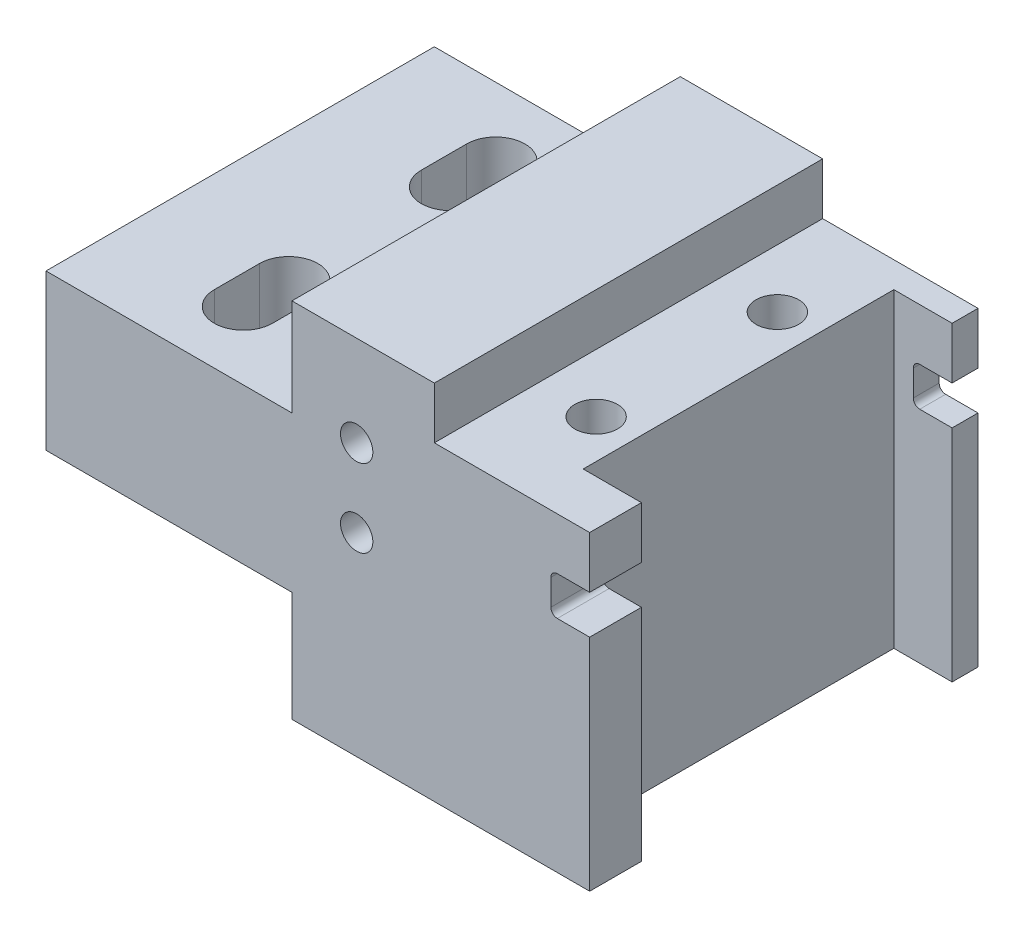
ISO-10303-21;
HEADER;
FILE_DESCRIPTION(('STEP AP214'),'2;1');
FILE_NAME('part.step','',(''),(''),'','','');
FILE_SCHEMA(('AUTOMOTIVE_DESIGN { 1 0 10303 214 1 1 1 1 }'));
ENDSEC;
DATA;
#1=APPLICATION_CONTEXT('core data for automotive mechanical design processes');
#2=APPLICATION_PROTOCOL_DEFINITION('international standard','automotive_design',2000,#1);
#3=PRODUCT_CONTEXT('',#1,'mechanical');
#4=PRODUCT('Part','Part','',(#3));
#5=PRODUCT_RELATED_PRODUCT_CATEGORY('part','',(#4));
#6=PRODUCT_DEFINITION_FORMATION('','',#4);
#7=PRODUCT_DEFINITION_CONTEXT('part definition',#1,'design');
#8=PRODUCT_DEFINITION('design','',#6,#7);
#9=PRODUCT_DEFINITION_SHAPE('','',#8);
#10=(LENGTH_UNIT() NAMED_UNIT(*) SI_UNIT(.MILLI.,.METRE.));
#11=(NAMED_UNIT(*) PLANE_ANGLE_UNIT() SI_UNIT($,.RADIAN.));
#12=(NAMED_UNIT(*) SI_UNIT($,.STERADIAN.) SOLID_ANGLE_UNIT());
#13=UNCERTAINTY_MEASURE_WITH_UNIT(LENGTH_MEASURE(1.E-05),#10,'distance_accuracy_value','');
#14=(GEOMETRIC_REPRESENTATION_CONTEXT(3) GLOBAL_UNCERTAINTY_ASSIGNED_CONTEXT((#13)) GLOBAL_UNIT_ASSIGNED_CONTEXT((#10,
#11,#12)) REPRESENTATION_CONTEXT('',''));
#15=CARTESIAN_POINT('',(0.,0.,0.));
#16=DIRECTION('',(0.,0.,1.));
#17=DIRECTION('',(1.,0.,0.));
#18=AXIS2_PLACEMENT_3D('',#15,#16,#17);
#19=CARTESIAN_POINT('',(178.,206.05458814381,-30.));
#20=DIRECTION('',(0.,-1.,0.));
#21=DIRECTION('',(1.,0.,0.));
#22=AXIS2_PLACEMENT_3D('',#19,#20,#21);
#23=PLANE('',#22);
#24=CARTESIAN_POINT('',(169.,206.05458814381,-8.75));
#25=DIRECTION('',(0.,-1.,0.));
#26=DIRECTION('',(0.,0.,-1.));
#27=AXIS2_PLACEMENT_3D('',#24,#25,#26);
#28=CIRCLE('',#27,4.);
#29=CARTESIAN_POINT('',(165.,206.05458814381,-8.75));
#30=VERTEX_POINT('',#29);
#31=CARTESIAN_POINT('',(173.,206.05458814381,-8.75));
#32=VERTEX_POINT('',#31);
#33=EDGE_CURVE('E389',#30,#32,#28,.T.);
#34=ORIENTED_EDGE('',*,*,#33,.F.);
#35=DIRECTION('',(0.,0.,-1.));
#36=VECTOR('',#35,1.);
#37=CARTESIAN_POINT('',(165.,206.05458814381,-5.25));
#38=LINE('',#37,#36);
#39=CARTESIAN_POINT('',(165.,206.05458814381,-5.25));
#40=VERTEX_POINT('',#39);
#41=EDGE_CURVE('E349',#40,#30,#38,.T.);
#42=ORIENTED_EDGE('',*,*,#41,.F.);
#43=CARTESIAN_POINT('',(169.,206.05458814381,-5.25));
#44=DIRECTION('',(0.,-1.,0.));
#45=DIRECTION('',(0.,0.,-1.));
#46=AXIS2_PLACEMENT_3D('',#43,#44,#45);
#47=CIRCLE('',#46,4.);
#48=CARTESIAN_POINT('',(173.,206.05458814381,-5.25));
#49=VERTEX_POINT('',#48);
#50=EDGE_CURVE('E370',#49,#40,#47,.T.);
#51=ORIENTED_EDGE('',*,*,#50,.F.);
#52=DIRECTION('',(0.,0.,-1.));
#53=VECTOR('',#52,1.);
#54=CARTESIAN_POINT('',(173.,206.05458814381,-5.25));
#55=LINE('',#54,#53);
#56=EDGE_CURVE('E360',#49,#32,#55,.T.);
#57=ORIENTED_EDGE('',*,*,#56,.T.);
#58=EDGE_LOOP('',(#34,#42,#51,#57));
#59=FACE_BOUND('',#58,.T.);
#60=DIRECTION('',(1.,0.,0.));
#61=VECTOR('',#60,1.);
#62=CARTESIAN_POINT('',(178.,206.05458814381,0.));
#63=LINE('',#62,#61);
#64=CARTESIAN_POINT('',(159.,206.05458814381,0.));
#65=VERTEX_POINT('',#64);
#66=CARTESIAN_POINT('',(178.,206.05458814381,0.));
#67=VERTEX_POINT('',#66);
#68=EDGE_CURVE('E544',#65,#67,#63,.T.);
#69=ORIENTED_EDGE('',*,*,#68,.F.);
#70=DIRECTION('',(0.,0.,1.));
#71=VECTOR('',#70,1.);
#72=CARTESIAN_POINT('',(159.,206.05458814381,-30.));
#73=LINE('',#72,#71);
#74=CARTESIAN_POINT('',(159.,206.05458814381,-30.));
#75=VERTEX_POINT('',#74);
#76=EDGE_CURVE('E541',#75,#65,#73,.T.);
#77=ORIENTED_EDGE('',*,*,#76,.F.);
#78=DIRECTION('',(1.,0.,0.));
#79=VECTOR('',#78,1.);
#80=CARTESIAN_POINT('',(178.,206.05458814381,-30.));
#81=LINE('',#80,#79);
#82=CARTESIAN_POINT('',(178.,206.05458814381,-30.));
#83=VERTEX_POINT('',#82);
#84=EDGE_CURVE('E519',#75,#83,#81,.T.);
#85=ORIENTED_EDGE('',*,*,#84,.T.);
#86=DIRECTION('',(0.,0.,1.));
#87=VECTOR('',#86,1.);
#88=CARTESIAN_POINT('',(178.,206.05458814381,-30.));
#89=LINE('',#88,#87);
#90=EDGE_CURVE('E578',#83,#67,#89,.T.);
#91=ORIENTED_EDGE('',*,*,#90,.T.);
#92=EDGE_LOOP('',(#69,#77,#85,#91));
#93=FACE_BOUND('',#92,.T.);
#94=CARTESIAN_POINT('',(169.,206.05458814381,-21.25));
#95=DIRECTION('',(0.,-1.,0.));
#96=DIRECTION('',(0.,0.,-1.));
#97=AXIS2_PLACEMENT_3D('',#94,#95,#96);
#98=CIRCLE('',#97,4.);
#99=CARTESIAN_POINT('',(173.,206.05458814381,-21.25));
#100=VERTEX_POINT('',#99);
#101=CARTESIAN_POINT('',(165.,206.05458814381,-21.25));
#102=VERTEX_POINT('',#101);
#103=EDGE_CURVE('E38',#100,#102,#98,.T.);
#104=ORIENTED_EDGE('',*,*,#103,.F.);
#105=DIRECTION('',(0.,0.,-1.));
#106=VECTOR('',#105,1.);
#107=CARTESIAN_POINT('',(173.,206.05458814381,-21.25));
#108=LINE('',#107,#106);
#109=CARTESIAN_POINT('',(173.,206.05458814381,-24.75));
#110=VERTEX_POINT('',#109);
#111=EDGE_CURVE('E305',#100,#110,#108,.T.);
#112=ORIENTED_EDGE('',*,*,#111,.T.);
#113=CARTESIAN_POINT('',(169.,206.05458814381,-24.75));
#114=DIRECTION('',(0.,-1.,0.));
#115=DIRECTION('',(0.,0.,-1.));
#116=AXIS2_PLACEMENT_3D('',#113,#114,#115);
#117=CIRCLE('',#116,4.);
#118=CARTESIAN_POINT('',(165.,206.05458814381,-24.75));
#119=VERTEX_POINT('',#118);
#120=EDGE_CURVE('E338',#119,#110,#117,.T.);
#121=ORIENTED_EDGE('',*,*,#120,.F.);
#122=DIRECTION('',(0.,0.,-1.));
#123=VECTOR('',#122,1.);
#124=CARTESIAN_POINT('',(165.,206.05458814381,-21.25));
#125=LINE('',#124,#123);
#126=EDGE_CURVE('E322',#102,#119,#125,.T.);
#127=ORIENTED_EDGE('',*,*,#126,.F.);
#128=EDGE_LOOP('',(#104,#112,#121,#127));
#129=FACE_BOUND('',#128,.T.);
#130=ADVANCED_FACE('F16',(#59,#93,#129),#23,.T.);
#131=CARTESIAN_POINT('',(201.,225.55458814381,-30.));
#132=DIRECTION('',(1.,0.,0.));
#133=DIRECTION('',(0.,1.,0.));
#134=AXIS2_PLACEMENT_3D('',#131,#132,#133);
#135=PLANE('',#134);
#136=DIRECTION('',(0.,0.,1.));
#137=VECTOR('',#136,1.);
#138=CARTESIAN_POINT('',(201.,214.554588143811,-30.));
#139=LINE('',#138,#137);
#140=CARTESIAN_POINT('',(201.,214.554588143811,-4.00000000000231));
#141=VERTEX_POINT('',#140);
#142=CARTESIAN_POINT('',(201.,214.554588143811,0.));
#143=VERTEX_POINT('',#142);
#144=EDGE_CURVE('E445',#141,#143,#139,.T.);
#145=ORIENTED_EDGE('',*,*,#144,.T.);
#146=DIRECTION('',(0.,1.,0.));
#147=VECTOR('',#146,1.);
#148=CARTESIAN_POINT('',(201.,225.55458814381,0.));
#149=LINE('',#148,#147);
#150=CARTESIAN_POINT('',(201.,197.554588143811,0.));
#151=VERTEX_POINT('',#150);
#152=EDGE_CURVE('E554',#151,#143,#149,.T.);
#153=ORIENTED_EDGE('',*,*,#152,.F.);
#154=DIRECTION('',(0.,0.,1.));
#155=VECTOR('',#154,1.);
#156=CARTESIAN_POINT('',(201.,197.554588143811,-30.));
#157=LINE('',#156,#155);
#158=CARTESIAN_POINT('',(201.,197.554588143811,-4.00000000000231));
#159=VERTEX_POINT('',#158);
#160=EDGE_CURVE('E575',#159,#151,#157,.T.);
#161=ORIENTED_EDGE('',*,*,#160,.F.);
#162=DIRECTION('',(0.,-1.,0.));
#163=VECTOR('',#162,1.);
#164=CARTESIAN_POINT('',(201.,225.55458814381,-4.00000000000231));
#165=LINE('',#164,#163);
#166=EDGE_CURVE('E510',#141,#159,#165,.T.);
#167=ORIENTED_EDGE('',*,*,#166,.F.);
#168=EDGE_LOOP('',(#145,#153,#161,#167));
#169=FACE_BOUND('',#168,.T.);
#170=ADVANCED_FACE('F684',(#169),#135,.T.);
#171=CARTESIAN_POINT('',(201.,214.554588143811,-30.));
#172=VERTEX_POINT('',#171);
#173=CARTESIAN_POINT('',(201.,214.554588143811,-28.0000000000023));
#174=VERTEX_POINT('',#173);
#175=EDGE_CURVE('E441',#172,#174,#139,.T.);
#176=ORIENTED_EDGE('',*,*,#175,.T.);
#177=DIRECTION('',(0.,-1.,0.));
#178=VECTOR('',#177,1.);
#179=CARTESIAN_POINT('',(201.,225.55458814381,-28.0000000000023));
#180=LINE('',#179,#178);
#181=CARTESIAN_POINT('',(201.,197.554588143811,-28.0000000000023));
#182=VERTEX_POINT('',#181);
#183=EDGE_CURVE('E514',#174,#182,#180,.T.);
#184=ORIENTED_EDGE('',*,*,#183,.T.);
#185=CARTESIAN_POINT('',(201.,197.554588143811,-30.));
#186=VERTEX_POINT('',#185);
#187=EDGE_CURVE('E572',#186,#182,#157,.T.);
#188=ORIENTED_EDGE('',*,*,#187,.F.);
#189=DIRECTION('',(0.,1.,0.));
#190=VECTOR('',#189,1.);
#191=CARTESIAN_POINT('',(201.,225.55458814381,-30.));
#192=LINE('',#191,#190);
#193=EDGE_CURVE('E530',#186,#172,#192,.T.);
#194=ORIENTED_EDGE('',*,*,#193,.T.);
#195=EDGE_LOOP('',(#176,#184,#188,#194));
#196=FACE_BOUND('',#195,.T.);
#197=ADVANCED_FACE('F691',(#196),#135,.T.);
#198=DIRECTION('',(0.,0.,1.));
#199=VECTOR('',#198,1.);
#200=CARTESIAN_POINT('',(201.,217.55458814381,-30.));
#201=LINE('',#200,#199);
#202=CARTESIAN_POINT('',(201.,217.55458814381,-4.00000000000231));
#203=VERTEX_POINT('',#202);
#204=CARTESIAN_POINT('',(201.,217.55458814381,0.));
#205=VERTEX_POINT('',#204);
#206=EDGE_CURVE('E434',#203,#205,#201,.T.);
#207=ORIENTED_EDGE('',*,*,#206,.F.);
#208=CARTESIAN_POINT('',(201.,221.55458814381,-4.00000000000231));
#209=VERTEX_POINT('',#208);
#210=EDGE_CURVE('E507',#209,#203,#165,.T.);
#211=ORIENTED_EDGE('',*,*,#210,.F.);
#212=DIRECTION('',(0.,0.,1.));
#213=VECTOR('',#212,1.);
#214=CARTESIAN_POINT('',(201.,221.55458814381,-30.));
#215=LINE('',#214,#213);
#216=CARTESIAN_POINT('',(201.,221.55458814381,0.));
#217=VERTEX_POINT('',#216);
#218=EDGE_CURVE('E485',#209,#217,#215,.T.);
#219=ORIENTED_EDGE('',*,*,#218,.T.);
#220=EDGE_CURVE('E553',#205,#217,#149,.T.);
#221=ORIENTED_EDGE('',*,*,#220,.F.);
#222=EDGE_LOOP('',(#207,#211,#219,#221));
#223=FACE_BOUND('',#222,.T.);
#224=ADVANCED_FACE('F704',(#223),#135,.T.);
#225=CARTESIAN_POINT('',(159.,218.05458814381,-30.));
#226=DIRECTION('',(-1.,0.,0.));
#227=DIRECTION('',(0.,0.,1.));
#228=AXIS2_PLACEMENT_3D('',#225,#226,#227);
#229=PLANE('',#228);
#230=DIRECTION('',(0.,-1.,0.));
#231=VECTOR('',#230,1.);
#232=CARTESIAN_POINT('',(159.,218.05458814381,0.));
#233=LINE('',#232,#231);
#234=CARTESIAN_POINT('',(159.,218.05458814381,0.));
#235=VERTEX_POINT('',#234);
#236=EDGE_CURVE('E506',#235,#65,#233,.T.);
#237=ORIENTED_EDGE('',*,*,#236,.F.);
#238=DIRECTION('',(0.,0.,1.));
#239=VECTOR('',#238,1.);
#240=CARTESIAN_POINT('',(159.,218.05458814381,-30.));
#241=LINE('',#240,#239);
#242=CARTESIAN_POINT('',(159.,218.05458814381,-30.));
#243=VERTEX_POINT('',#242);
#244=EDGE_CURVE('E564',#243,#235,#241,.T.);
#245=ORIENTED_EDGE('',*,*,#244,.F.);
#246=DIRECTION('',(0.,-1.,0.));
#247=VECTOR('',#246,1.);
#248=CARTESIAN_POINT('',(159.,218.05458814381,-30.));
#249=LINE('',#248,#247);
#250=EDGE_CURVE('E516',#243,#75,#249,.T.);
#251=ORIENTED_EDGE('',*,*,#250,.T.);
#252=ORIENTED_EDGE('',*,*,#76,.T.);
#253=EDGE_LOOP('',(#237,#245,#251,#252));
#254=FACE_BOUND('',#253,.T.);
#255=ADVANCED_FACE('F701',(#254),#229,.T.);
#256=CARTESIAN_POINT('',(178.,218.05458814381,-30.));
#257=DIRECTION('',(0.,1.,0.));
#258=DIRECTION('',(0.,0.,1.));
#259=AXIS2_PLACEMENT_3D('',#256,#257,#258);
#260=PLANE('',#259);
#261=CARTESIAN_POINT('',(169.,218.05458814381,-24.75));
#262=DIRECTION('',(0.,1.,0.));
#263=DIRECTION('',(0.,0.,1.));
#264=AXIS2_PLACEMENT_3D('',#261,#262,#263);
#265=CIRCLE('',#264,2.25);
#266=CARTESIAN_POINT('',(171.25,218.05458814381,-24.75));
#267=VERTEX_POINT('',#266);
#268=CARTESIAN_POINT('',(166.75,218.05458814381,-24.75));
#269=VERTEX_POINT('',#268);
#270=EDGE_CURVE('E11',#267,#269,#265,.T.);
#271=ORIENTED_EDGE('',*,*,#270,.F.);
#272=DIRECTION('',(0.,0.,1.));
#273=VECTOR('',#272,1.);
#274=CARTESIAN_POINT('',(171.25,218.05458814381,-30.));
#275=LINE('',#274,#273);
#276=CARTESIAN_POINT('',(171.25,218.05458814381,-21.25));
#277=VERTEX_POINT('',#276);
#278=EDGE_CURVE('E24',#267,#277,#275,.T.);
#279=ORIENTED_EDGE('',*,*,#278,.T.);
#280=CARTESIAN_POINT('',(169.,218.05458814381,-21.25));
#281=DIRECTION('',(0.,1.,0.));
#282=DIRECTION('',(0.,0.,1.));
#283=AXIS2_PLACEMENT_3D('',#280,#281,#282);
#284=CIRCLE('',#283,2.25);
#285=CARTESIAN_POINT('',(166.75,218.05458814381,-21.25));
#286=VERTEX_POINT('',#285);
#287=EDGE_CURVE('E639',#286,#277,#284,.T.);
#288=ORIENTED_EDGE('',*,*,#287,.F.);
#289=DIRECTION('',(0.,0.,1.));
#290=VECTOR('',#289,1.);
#291=CARTESIAN_POINT('',(166.75,218.05458814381,-30.));
#292=LINE('',#291,#290);
#293=EDGE_CURVE('E637',#269,#286,#292,.T.);
#294=ORIENTED_EDGE('',*,*,#293,.F.);
#295=EDGE_LOOP('',(#271,#279,#288,#294));
#296=FACE_BOUND('',#295,.T.);
#297=DIRECTION('',(0.,0.,1.));
#298=VECTOR('',#297,1.);
#299=CARTESIAN_POINT('',(166.75,218.05458814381,-30.));
#300=LINE('',#299,#298);
#301=CARTESIAN_POINT('',(166.75,218.05458814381,-8.75));
#302=VERTEX_POINT('',#301);
#303=CARTESIAN_POINT('',(166.75,218.05458814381,-5.25));
#304=VERTEX_POINT('',#303);
#305=EDGE_CURVE('E635',#302,#304,#300,.T.);
#306=ORIENTED_EDGE('',*,*,#305,.F.);
#307=CARTESIAN_POINT('',(169.,218.05458814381,-8.75));
#308=DIRECTION('',(0.,1.,0.));
#309=DIRECTION('',(0.,0.,1.));
#310=AXIS2_PLACEMENT_3D('',#307,#308,#309);
#311=CIRCLE('',#310,2.25);
#312=CARTESIAN_POINT('',(171.25,218.05458814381,-8.75));
#313=VERTEX_POINT('',#312);
#314=EDGE_CURVE('E633',#313,#302,#311,.T.);
#315=ORIENTED_EDGE('',*,*,#314,.F.);
#316=DIRECTION('',(0.,0.,1.));
#317=VECTOR('',#316,1.);
#318=CARTESIAN_POINT('',(171.25,218.05458814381,-30.));
#319=LINE('',#318,#317);
#320=CARTESIAN_POINT('',(171.25,218.05458814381,-5.25));
#321=VERTEX_POINT('',#320);
#322=EDGE_CURVE('E627',#313,#321,#319,.T.);
#323=ORIENTED_EDGE('',*,*,#322,.T.);
#324=CARTESIAN_POINT('',(169.,218.05458814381,-5.25));
#325=DIRECTION('',(0.,1.,0.));
#326=DIRECTION('',(0.,0.,1.));
#327=AXIS2_PLACEMENT_3D('',#324,#325,#326);
#328=CIRCLE('',#327,2.25);
#329=EDGE_CURVE('E630',#304,#321,#328,.T.);
#330=ORIENTED_EDGE('',*,*,#329,.F.);
#331=EDGE_LOOP('',(#306,#315,#323,#330));
#332=FACE_BOUND('',#331,.T.);
#333=DIRECTION('',(-1.,0.,0.));
#334=VECTOR('',#333,1.);
#335=CARTESIAN_POINT('',(178.,218.05458814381,0.));
#336=LINE('',#335,#334);
#337=CARTESIAN_POINT('',(178.,218.05458814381,0.));
#338=VERTEX_POINT('',#337);
#339=EDGE_CURVE('E520',#338,#235,#336,.T.);
#340=ORIENTED_EDGE('',*,*,#339,.F.);
#341=DIRECTION('',(0.,0.,1.));
#342=VECTOR('',#341,1.);
#343=CARTESIAN_POINT('',(178.,218.05458814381,-30.));
#344=LINE('',#343,#342);
#345=CARTESIAN_POINT('',(178.,218.05458814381,-30.));
#346=VERTEX_POINT('',#345);
#347=EDGE_CURVE('E567',#346,#338,#344,.T.);
#348=ORIENTED_EDGE('',*,*,#347,.F.);
#349=DIRECTION('',(-1.,0.,0.));
#350=VECTOR('',#349,1.);
#351=CARTESIAN_POINT('',(178.,218.05458814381,-30.));
#352=LINE('',#351,#350);
#353=EDGE_CURVE('E538',#346,#243,#352,.T.);
#354=ORIENTED_EDGE('',*,*,#353,.T.);
#355=ORIENTED_EDGE('',*,*,#244,.T.);
#356=EDGE_LOOP('',(#340,#348,#354,#355));
#357=FACE_BOUND('',#356,.T.);
#358=ADVANCED_FACE('F644',(#296,#332,#357),#260,.T.);
#359=CARTESIAN_POINT('',(178.,218.05458814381,-30.));
#360=DIRECTION('',(-1.,0.,0.));
#361=DIRECTION('',(0.,0.,1.));
#362=AXIS2_PLACEMENT_3D('',#359,#360,#361);
#363=PLANE('',#362);
#364=DIRECTION('',(0.,-1.,0.));
#365=VECTOR('',#364,1.);
#366=CARTESIAN_POINT('',(178.,218.05458814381,0.));
#367=LINE('',#366,#365);
#368=CARTESIAN_POINT('',(178.,225.55458814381,0.));
#369=VERTEX_POINT('',#368);
#370=EDGE_CURVE('E559',#369,#338,#367,.T.);
#371=ORIENTED_EDGE('',*,*,#370,.F.);
#372=DIRECTION('',(0.,0.,1.));
#373=VECTOR('',#372,1.);
#374=CARTESIAN_POINT('',(178.,225.55458814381,-30.));
#375=LINE('',#374,#373);
#376=CARTESIAN_POINT('',(178.,225.55458814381,-30.));
#377=VERTEX_POINT('',#376);
#378=EDGE_CURVE('E569',#377,#369,#375,.T.);
#379=ORIENTED_EDGE('',*,*,#378,.F.);
#380=DIRECTION('',(0.,-1.,0.));
#381=VECTOR('',#380,1.);
#382=CARTESIAN_POINT('',(178.,218.05458814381,-30.));
#383=LINE('',#382,#381);
#384=EDGE_CURVE('E535',#377,#346,#383,.T.);
#385=ORIENTED_EDGE('',*,*,#384,.T.);
#386=ORIENTED_EDGE('',*,*,#347,.T.);
#387=EDGE_LOOP('',(#371,#379,#385,#386));
#388=FACE_BOUND('',#387,.T.);
#389=ADVANCED_FACE('F784',(#388),#363,.T.);
#390=CARTESIAN_POINT('',(178.,225.55458814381,-30.));
#391=DIRECTION('',(0.,1.,0.));
#392=DIRECTION('',(0.,0.,1.));
#393=AXIS2_PLACEMENT_3D('',#390,#391,#392);
#394=PLANE('',#393);
#395=DIRECTION('',(0.,0.,1.));
#396=VECTOR('',#395,1.);
#397=CARTESIAN_POINT('',(189.,225.55458814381,-30.));
#398=LINE('',#397,#396);
#399=CARTESIAN_POINT('',(189.,225.55458814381,-30.));
#400=VERTEX_POINT('',#399);
#401=CARTESIAN_POINT('',(189.,225.55458814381,0.));
#402=VERTEX_POINT('',#401);
#403=EDGE_CURVE('E476',#400,#402,#398,.T.);
#404=ORIENTED_EDGE('',*,*,#403,.F.);
#405=DIRECTION('',(-1.,0.,0.));
#406=VECTOR('',#405,1.);
#407=CARTESIAN_POINT('',(178.,225.55458814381,-30.));
#408=LINE('',#407,#406);
#409=EDGE_CURVE('E533',#400,#377,#408,.T.);
#410=ORIENTED_EDGE('',*,*,#409,.T.);
#411=ORIENTED_EDGE('',*,*,#378,.T.);
#412=DIRECTION('',(-1.,0.,0.));
#413=VECTOR('',#412,1.);
#414=CARTESIAN_POINT('',(178.,225.55458814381,0.));
#415=LINE('',#414,#413);
#416=EDGE_CURVE('E557',#402,#369,#415,.T.);
#417=ORIENTED_EDGE('',*,*,#416,.F.);
#418=EDGE_LOOP('',(#404,#410,#411,#417));
#419=FACE_BOUND('',#418,.T.);
#420=ADVANCED_FACE('F788',(#419),#394,.T.);
#421=CARTESIAN_POINT('',(201.,217.55458814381,-30.));
#422=VERTEX_POINT('',#421);
#423=CARTESIAN_POINT('',(201.,217.55458814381,-28.0000000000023));
#424=VERTEX_POINT('',#423);
#425=EDGE_CURVE('E446',#422,#424,#201,.T.);
#426=ORIENTED_EDGE('',*,*,#425,.F.);
#427=CARTESIAN_POINT('',(201.,221.55458814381,-30.));
#428=VERTEX_POINT('',#427);
#429=EDGE_CURVE('E529',#422,#428,#192,.T.);
#430=ORIENTED_EDGE('',*,*,#429,.T.);
#431=CARTESIAN_POINT('',(201.,221.55458814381,-28.0000000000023));
#432=VERTEX_POINT('',#431);
#433=EDGE_CURVE('E481',#428,#432,#215,.T.);
#434=ORIENTED_EDGE('',*,*,#433,.T.);
#435=EDGE_CURVE('E511',#432,#424,#180,.T.);
#436=ORIENTED_EDGE('',*,*,#435,.T.);
#437=EDGE_LOOP('',(#426,#430,#434,#436));
#438=FACE_BOUND('',#437,.T.);
#439=ADVANCED_FACE('F694',(#438),#135,.T.);
#440=CARTESIAN_POINT('',(178.,197.554588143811,-30.));
#441=DIRECTION('',(0.,-1.,0.));
#442=DIRECTION('',(0.,0.,-1.));
#443=AXIS2_PLACEMENT_3D('',#440,#441,#442);
#444=PLANE('',#443);
#445=DIRECTION('',(-1.,0.,0.));
#446=VECTOR('',#445,1.);
#447=CARTESIAN_POINT('',(196.5,197.554588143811,-4.00000000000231));
#448=LINE('',#447,#446);
#449=CARTESIAN_POINT('',(196.5,197.554588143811,-4.00000000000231));
#450=VERTEX_POINT('',#449);
#451=EDGE_CURVE('E500',#159,#450,#448,.T.);
#452=ORIENTED_EDGE('',*,*,#451,.F.);
#453=ORIENTED_EDGE('',*,*,#160,.T.);
#454=DIRECTION('',(1.,0.,0.));
#455=VECTOR('',#454,1.);
#456=CARTESIAN_POINT('',(178.,197.554588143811,0.));
#457=LINE('',#456,#455);
#458=CARTESIAN_POINT('',(178.,197.554588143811,0.));
#459=VERTEX_POINT('',#458);
#460=EDGE_CURVE('E550',#459,#151,#457,.T.);
#461=ORIENTED_EDGE('',*,*,#460,.F.);
#462=DIRECTION('',(0.,0.,1.));
#463=VECTOR('',#462,1.);
#464=CARTESIAN_POINT('',(178.,197.554588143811,-30.));
#465=LINE('',#464,#463);
#466=CARTESIAN_POINT('',(178.,197.554588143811,-30.));
#467=VERTEX_POINT('',#466);
#468=EDGE_CURVE('E576',#467,#459,#465,.T.);
#469=ORIENTED_EDGE('',*,*,#468,.F.);
#470=DIRECTION('',(1.,0.,0.));
#471=VECTOR('',#470,1.);
#472=CARTESIAN_POINT('',(178.,197.554588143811,-30.));
#473=LINE('',#472,#471);
#474=EDGE_CURVE('E526',#467,#186,#473,.T.);
#475=ORIENTED_EDGE('',*,*,#474,.T.);
#476=ORIENTED_EDGE('',*,*,#187,.T.);
#477=DIRECTION('',(1.,0.,0.));
#478=VECTOR('',#477,1.);
#479=CARTESIAN_POINT('',(196.5,197.554588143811,-28.0000000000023));
#480=LINE('',#479,#478);
#481=CARTESIAN_POINT('',(196.5,197.554588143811,-28.0000000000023));
#482=VERTEX_POINT('',#481);
#483=EDGE_CURVE('E497',#482,#182,#480,.T.);
#484=ORIENTED_EDGE('',*,*,#483,.F.);
#485=DIRECTION('',(0.,0.,-1.));
#486=VECTOR('',#485,1.);
#487=CARTESIAN_POINT('',(196.5,197.554588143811,-28.0000000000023));
#488=LINE('',#487,#486);
#489=EDGE_CURVE('E494',#450,#482,#488,.T.);
#490=ORIENTED_EDGE('',*,*,#489,.F.);
#491=EDGE_LOOP('',(#452,#453,#461,#469,#475,#476,#484,#490));
#492=FACE_BOUND('',#491,.T.);
#493=ADVANCED_FACE('F748',(#492),#444,.T.);
#494=CARTESIAN_POINT('',(178.,206.05458814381,-30.));
#495=DIRECTION('',(-1.,0.,0.));
#496=DIRECTION('',(0.,-1.,0.));
#497=AXIS2_PLACEMENT_3D('',#494,#495,#496);
#498=PLANE('',#497);
#499=DIRECTION('',(0.,-1.,0.));
#500=VECTOR('',#499,1.);
#501=CARTESIAN_POINT('',(178.,206.05458814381,0.));
#502=LINE('',#501,#500);
#503=EDGE_CURVE('E547',#67,#459,#502,.T.);
#504=ORIENTED_EDGE('',*,*,#503,.F.);
#505=ORIENTED_EDGE('',*,*,#90,.F.);
#506=DIRECTION('',(0.,-1.,0.));
#507=VECTOR('',#506,1.);
#508=CARTESIAN_POINT('',(178.,206.05458814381,-30.));
#509=LINE('',#508,#507);
#510=EDGE_CURVE('E523',#83,#467,#509,.T.);
#511=ORIENTED_EDGE('',*,*,#510,.T.);
#512=ORIENTED_EDGE('',*,*,#468,.T.);
#513=EDGE_LOOP('',(#504,#505,#511,#512));
#514=FACE_BOUND('',#513,.T.);
#515=ADVANCED_FACE('F699',(#514),#498,.T.);
#516=CARTESIAN_POINT('',(0.,0.,-30.));
#517=DIRECTION('',(0.,0.,-1.));
#518=DIRECTION('',(-1.,0.,0.));
#519=AXIS2_PLACEMENT_3D('',#516,#517,#518);
#520=PLANE('',#519);
#521=CARTESIAN_POINT('',(183.,212.554588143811,-30.));
#522=DIRECTION('',(0.,0.,-1.));
#523=DIRECTION('',(-1.,0.,0.));
#524=AXIS2_PLACEMENT_3D('',#521,#522,#523);
#525=CIRCLE('',#524,1.25);
#526=CARTESIAN_POINT('',(181.75,212.554588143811,-30.));
#527=VERTEX_POINT('',#526);
#528=EDGE_CURVE('E412',#527,#527,#525,.T.);
#529=ORIENTED_EDGE('',*,*,#528,.F.);
#530=EDGE_LOOP('',(#529));
#531=FACE_BOUND('',#530,.T.);
#532=CARTESIAN_POINT('',(183.,218.55458814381,-30.));
#533=DIRECTION('',(0.,0.,-1.));
#534=DIRECTION('',(-1.,0.,0.));
#535=AXIS2_PLACEMENT_3D('',#532,#533,#534);
#536=CIRCLE('',#535,1.25);
#537=CARTESIAN_POINT('',(181.75,218.55458814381,-30.));
#538=VERTEX_POINT('',#537);
#539=EDGE_CURVE('E418',#538,#538,#536,.T.);
#540=ORIENTED_EDGE('',*,*,#539,.F.);
#541=EDGE_LOOP('',(#540));
#542=FACE_BOUND('',#541,.T.);
#543=DIRECTION('',(0.,-1.,0.));
#544=VECTOR('',#543,1.);
#545=CARTESIAN_POINT('',(198.,214.554588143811,-30.));
#546=LINE('',#545,#544);
#547=CARTESIAN_POINT('',(198.,217.05458814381,-30.));
#548=VERTEX_POINT('',#547);
#549=CARTESIAN_POINT('',(198.,215.05458814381,-30.));
#550=VERTEX_POINT('',#549);
#551=EDGE_CURVE('E428',#548,#550,#546,.T.);
#552=ORIENTED_EDGE('',*,*,#551,.T.);
#553=CARTESIAN_POINT('',(198.5,215.05458814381,-30.));
#554=DIRECTION('',(0.,0.,-1.));
#555=DIRECTION('',(-1.,0.,0.));
#556=AXIS2_PLACEMENT_3D('',#553,#554,#555);
#557=CIRCLE('',#556,0.5);
#558=CARTESIAN_POINT('',(198.5,214.554588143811,-30.));
#559=VERTEX_POINT('',#558);
#560=EDGE_CURVE('E613',#550,#559,#557,.F.);
#561=ORIENTED_EDGE('',*,*,#560,.T.);
#562=DIRECTION('',(1.,0.,0.));
#563=VECTOR('',#562,1.);
#564=CARTESIAN_POINT('',(201.,214.554588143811,-30.));
#565=LINE('',#564,#563);
#566=EDGE_CURVE('E432',#559,#172,#565,.T.);
#567=ORIENTED_EDGE('',*,*,#566,.T.);
#568=ORIENTED_EDGE('',*,*,#193,.F.);
#569=ORIENTED_EDGE('',*,*,#474,.F.);
#570=ORIENTED_EDGE('',*,*,#510,.F.);
#571=ORIENTED_EDGE('',*,*,#84,.F.);
#572=ORIENTED_EDGE('',*,*,#250,.F.);
#573=ORIENTED_EDGE('',*,*,#353,.F.);
#574=ORIENTED_EDGE('',*,*,#384,.F.);
#575=ORIENTED_EDGE('',*,*,#409,.F.);
#576=DIRECTION('',(0.,-1.,0.));
#577=VECTOR('',#576,1.);
#578=CARTESIAN_POINT('',(189.,225.55458814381,-30.));
#579=LINE('',#578,#577);
#580=CARTESIAN_POINT('',(189.,221.55458814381,-30.));
#581=VERTEX_POINT('',#580);
#582=EDGE_CURVE('E469',#400,#581,#579,.T.);
#583=ORIENTED_EDGE('',*,*,#582,.T.);
#584=DIRECTION('',(1.,0.,0.));
#585=VECTOR('',#584,1.);
#586=CARTESIAN_POINT('',(201.,221.55458814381,-30.));
#587=LINE('',#586,#585);
#588=EDGE_CURVE('E472',#581,#428,#587,.T.);
#589=ORIENTED_EDGE('',*,*,#588,.T.);
#590=ORIENTED_EDGE('',*,*,#429,.F.);
#591=DIRECTION('',(-1.,0.,0.));
#592=VECTOR('',#591,1.);
#593=CARTESIAN_POINT('',(201.,217.55458814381,-30.));
#594=LINE('',#593,#592);
#595=CARTESIAN_POINT('',(198.5,217.55458814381,-30.));
#596=VERTEX_POINT('',#595);
#597=EDGE_CURVE('E425',#422,#596,#594,.T.);
#598=ORIENTED_EDGE('',*,*,#597,.T.);
#599=CARTESIAN_POINT('',(198.5,217.05458814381,-30.));
#600=DIRECTION('',(0.,0.,-1.));
#601=DIRECTION('',(-1.,0.,0.));
#602=AXIS2_PLACEMENT_3D('',#599,#600,#601);
#603=CIRCLE('',#602,0.5);
#604=EDGE_CURVE('E617',#596,#548,#603,.F.);
#605=ORIENTED_EDGE('',*,*,#604,.T.);
#606=EDGE_LOOP('',(#552,#561,#567,#568,#569,#570,#571,#572,#573,#574,#575,#583,#589,#590,#598,#605));
#607=FACE_BOUND('',#606,.T.);
#608=ADVANCED_FACE('F771',(#531,#542,#607),#520,.T.);
#609=CARTESIAN_POINT('',(0.,0.,0.));
#610=DIRECTION('',(0.,0.,-1.));
#611=DIRECTION('',(-1.,0.,0.));
#612=AXIS2_PLACEMENT_3D('',#609,#610,#611);
#613=PLANE('',#612);
#614=CARTESIAN_POINT('',(183.,212.554588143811,0.));
#615=DIRECTION('',(0.,0.,1.));
#616=DIRECTION('',(1.,0.,0.));
#617=AXIS2_PLACEMENT_3D('',#614,#615,#616);
#618=CIRCLE('',#617,1.25);
#619=CARTESIAN_POINT('',(184.25,212.554588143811,0.));
#620=VERTEX_POINT('',#619);
#621=EDGE_CURVE('E400',#620,#620,#618,.T.);
#622=ORIENTED_EDGE('',*,*,#621,.F.);
#623=EDGE_LOOP('',(#622));
#624=FACE_BOUND('',#623,.T.);
#625=CARTESIAN_POINT('',(183.,218.55458814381,0.));
#626=DIRECTION('',(0.,0.,1.));
#627=DIRECTION('',(1.,0.,0.));
#628=AXIS2_PLACEMENT_3D('',#625,#626,#627);
#629=CIRCLE('',#628,1.25);
#630=CARTESIAN_POINT('',(184.25,218.55458814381,0.));
#631=VERTEX_POINT('',#630);
#632=EDGE_CURVE('E406',#631,#631,#629,.T.);
#633=ORIENTED_EDGE('',*,*,#632,.F.);
#634=EDGE_LOOP('',(#633));
#635=FACE_BOUND('',#634,.T.);
#636=ORIENTED_EDGE('',*,*,#152,.T.);
#637=DIRECTION('',(1.,0.,0.));
#638=VECTOR('',#637,1.);
#639=CARTESIAN_POINT('',(201.,214.554588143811,0.));
#640=LINE('',#639,#638);
#641=CARTESIAN_POINT('',(198.5,214.554588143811,0.));
#642=VERTEX_POINT('',#641);
#643=EDGE_CURVE('E429',#642,#143,#640,.T.);
#644=ORIENTED_EDGE('',*,*,#643,.F.);
#645=CARTESIAN_POINT('',(198.5,215.05458814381,0.));
#646=DIRECTION('',(0.,0.,-1.));
#647=DIRECTION('',(-1.,0.,0.));
#648=AXIS2_PLACEMENT_3D('',#645,#646,#647);
#649=CIRCLE('',#648,0.5);
#650=CARTESIAN_POINT('',(198.,215.05458814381,0.));
#651=VERTEX_POINT('',#650);
#652=EDGE_CURVE('E623',#642,#651,#649,.T.);
#653=ORIENTED_EDGE('',*,*,#652,.T.);
#654=DIRECTION('',(0.,-1.,0.));
#655=VECTOR('',#654,1.);
#656=CARTESIAN_POINT('',(198.,214.554588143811,0.));
#657=LINE('',#656,#655);
#658=CARTESIAN_POINT('',(198.,217.05458814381,0.));
#659=VERTEX_POINT('',#658);
#660=EDGE_CURVE('E437',#659,#651,#657,.T.);
#661=ORIENTED_EDGE('',*,*,#660,.F.);
#662=CARTESIAN_POINT('',(198.5,217.05458814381,0.));
#663=DIRECTION('',(0.,0.,-1.));
#664=DIRECTION('',(-1.,0.,0.));
#665=AXIS2_PLACEMENT_3D('',#662,#663,#664);
#666=CIRCLE('',#665,0.5);
#667=CARTESIAN_POINT('',(198.5,217.55458814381,0.));
#668=VERTEX_POINT('',#667);
#669=EDGE_CURVE('E619',#659,#668,#666,.T.);
#670=ORIENTED_EDGE('',*,*,#669,.T.);
#671=DIRECTION('',(-1.,0.,0.));
#672=VECTOR('',#671,1.);
#673=CARTESIAN_POINT('',(201.,217.55458814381,0.));
#674=LINE('',#673,#672);
#675=EDGE_CURVE('E424',#205,#668,#674,.T.);
#676=ORIENTED_EDGE('',*,*,#675,.F.);
#677=ORIENTED_EDGE('',*,*,#220,.T.);
#678=DIRECTION('',(1.,0.,0.));
#679=VECTOR('',#678,1.);
#680=CARTESIAN_POINT('',(201.,221.55458814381,0.));
#681=LINE('',#680,#679);
#682=CARTESIAN_POINT('',(189.,221.55458814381,0.));
#683=VERTEX_POINT('',#682);
#684=EDGE_CURVE('E473',#683,#217,#681,.T.);
#685=ORIENTED_EDGE('',*,*,#684,.F.);
#686=DIRECTION('',(0.,-1.,0.));
#687=VECTOR('',#686,1.);
#688=CARTESIAN_POINT('',(189.,225.55458814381,0.));
#689=LINE('',#688,#687);
#690=EDGE_CURVE('E468',#402,#683,#689,.T.);
#691=ORIENTED_EDGE('',*,*,#690,.F.);
#692=ORIENTED_EDGE('',*,*,#416,.T.);
#693=ORIENTED_EDGE('',*,*,#370,.T.);
#694=ORIENTED_EDGE('',*,*,#339,.T.);
#695=ORIENTED_EDGE('',*,*,#236,.T.);
#696=ORIENTED_EDGE('',*,*,#68,.T.);
#697=ORIENTED_EDGE('',*,*,#503,.T.);
#698=ORIENTED_EDGE('',*,*,#460,.T.);
#699=EDGE_LOOP('',(#636,#644,#653,#661,#670,#676,#677,#685,#691,#692,#693,#694,#695,#696,#697,#698));
#700=FACE_BOUND('',#699,.T.);
#701=ADVANCED_FACE('F763',(#624,#635,#700),#613,.F.);
#702=CARTESIAN_POINT('',(196.5,225.55458814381,-28.0000000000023));
#703=DIRECTION('',(-1.,0.,0.));
#704=DIRECTION('',(0.,0.,1.));
#705=AXIS2_PLACEMENT_3D('',#702,#703,#704);
#706=PLANE('',#705);
#707=DIRECTION('',(0.,-1.,0.));
#708=VECTOR('',#707,1.);
#709=CARTESIAN_POINT('',(196.5,225.55458814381,-28.0000000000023));
#710=LINE('',#709,#708);
#711=CARTESIAN_POINT('',(196.5,221.55458814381,-28.0000000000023));
#712=VERTEX_POINT('',#711);
#713=EDGE_CURVE('E503',#712,#482,#710,.T.);
#714=ORIENTED_EDGE('',*,*,#713,.F.);
#715=DIRECTION('',(0.,0.,1.));
#716=VECTOR('',#715,1.);
#717=CARTESIAN_POINT('',(196.5,221.55458814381,-28.0000000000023));
#718=LINE('',#717,#716);
#719=CARTESIAN_POINT('',(196.5,221.55458814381,-4.00000000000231));
#720=VERTEX_POINT('',#719);
#721=EDGE_CURVE('E484',#712,#720,#718,.T.);
#722=ORIENTED_EDGE('',*,*,#721,.T.);
#723=DIRECTION('',(0.,-1.,0.));
#724=VECTOR('',#723,1.);
#725=CARTESIAN_POINT('',(196.5,225.55458814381,-4.00000000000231));
#726=LINE('',#725,#724);
#727=EDGE_CURVE('E504',#720,#450,#726,.T.);
#728=ORIENTED_EDGE('',*,*,#727,.T.);
#729=ORIENTED_EDGE('',*,*,#489,.T.);
#730=EDGE_LOOP('',(#714,#722,#728,#729));
#731=FACE_BOUND('',#730,.T.);
#732=ADVANCED_FACE('F753',(#731),#706,.F.);
#733=CARTESIAN_POINT('',(196.5,225.55458814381,-4.00000000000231));
#734=DIRECTION('',(0.,0.,1.));
#735=DIRECTION('',(1.,0.,0.));
#736=AXIS2_PLACEMENT_3D('',#733,#734,#735);
#737=PLANE('',#736);
#738=DIRECTION('',(-1.,0.,0.));
#739=VECTOR('',#738,1.);
#740=CARTESIAN_POINT('',(196.5,217.55458814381,-4.00000000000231));
#741=LINE('',#740,#739);
#742=CARTESIAN_POINT('',(198.5,217.55458814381,-4.00000000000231));
#743=VERTEX_POINT('',#742);
#744=EDGE_CURVE('E444',#203,#743,#741,.T.);
#745=ORIENTED_EDGE('',*,*,#744,.T.);
#746=CARTESIAN_POINT('',(198.5,217.05458814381,-4.00000000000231));
#747=DIRECTION('',(0.,0.,1.));
#748=DIRECTION('',(1.,0.,0.));
#749=AXIS2_PLACEMENT_3D('',#746,#747,#748);
#750=CIRCLE('',#749,0.5);
#751=CARTESIAN_POINT('',(198.,217.05458814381,-4.00000000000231));
#752=VERTEX_POINT('',#751);
#753=EDGE_CURVE('E621',#743,#752,#750,.T.);
#754=ORIENTED_EDGE('',*,*,#753,.T.);
#755=DIRECTION('',(0.,-1.,0.));
#756=VECTOR('',#755,1.);
#757=CARTESIAN_POINT('',(198.,225.55458814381,-4.00000000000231));
#758=LINE('',#757,#756);
#759=CARTESIAN_POINT('',(198.,215.05458814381,-4.00000000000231));
#760=VERTEX_POINT('',#759);
#761=EDGE_CURVE('E451',#752,#760,#758,.T.);
#762=ORIENTED_EDGE('',*,*,#761,.T.);
#763=CARTESIAN_POINT('',(198.5,215.05458814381,-4.00000000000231));
#764=DIRECTION('',(0.,0.,1.));
#765=DIRECTION('',(1.,0.,0.));
#766=AXIS2_PLACEMENT_3D('',#763,#764,#765);
#767=CIRCLE('',#766,0.5);
#768=CARTESIAN_POINT('',(198.5,214.554588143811,-4.00000000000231));
#769=VERTEX_POINT('',#768);
#770=EDGE_CURVE('E625',#760,#769,#767,.T.);
#771=ORIENTED_EDGE('',*,*,#770,.T.);
#772=DIRECTION('',(1.,0.,0.));
#773=VECTOR('',#772,1.);
#774=CARTESIAN_POINT('',(196.5,214.554588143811,-4.00000000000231));
#775=LINE('',#774,#773);
#776=EDGE_CURVE('E454',#769,#141,#775,.T.);
#777=ORIENTED_EDGE('',*,*,#776,.T.);
#778=ORIENTED_EDGE('',*,*,#166,.T.);
#779=ORIENTED_EDGE('',*,*,#451,.T.);
#780=ORIENTED_EDGE('',*,*,#727,.F.);
#781=DIRECTION('',(1.,0.,0.));
#782=VECTOR('',#781,1.);
#783=CARTESIAN_POINT('',(196.5,221.55458814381,-4.00000000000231));
#784=LINE('',#783,#782);
#785=EDGE_CURVE('E491',#720,#209,#784,.T.);
#786=ORIENTED_EDGE('',*,*,#785,.T.);
#787=ORIENTED_EDGE('',*,*,#210,.T.);
#788=EDGE_LOOP('',(#745,#754,#762,#771,#777,#778,#779,#780,#786,#787));
#789=FACE_BOUND('',#788,.T.);
#790=ADVANCED_FACE('F728',(#789),#737,.F.);
#791=CARTESIAN_POINT('',(196.5,225.55458814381,-28.0000000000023));
#792=DIRECTION('',(0.,0.,-1.));
#793=DIRECTION('',(-1.,0.,0.));
#794=AXIS2_PLACEMENT_3D('',#791,#792,#793);
#795=PLANE('',#794);
#796=ORIENTED_EDGE('',*,*,#183,.F.);
#797=DIRECTION('',(-1.,0.,0.));
#798=VECTOR('',#797,1.);
#799=CARTESIAN_POINT('',(196.5,214.554588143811,-28.0000000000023));
#800=LINE('',#799,#798);
#801=CARTESIAN_POINT('',(198.5,214.554588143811,-28.0000000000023));
#802=VERTEX_POINT('',#801);
#803=EDGE_CURVE('E588',#174,#802,#800,.T.);
#804=ORIENTED_EDGE('',*,*,#803,.T.);
#805=CARTESIAN_POINT('',(198.5,215.05458814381,-28.0000000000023));
#806=DIRECTION('',(0.,0.,-1.));
#807=DIRECTION('',(-1.,0.,0.));
#808=AXIS2_PLACEMENT_3D('',#805,#806,#807);
#809=CIRCLE('',#808,0.5);
#810=CARTESIAN_POINT('',(198.,215.05458814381,-28.0000000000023));
#811=VERTEX_POINT('',#810);
#812=EDGE_CURVE('E611',#802,#811,#809,.T.);
#813=ORIENTED_EDGE('',*,*,#812,.T.);
#814=DIRECTION('',(0.,1.,0.));
#815=VECTOR('',#814,1.);
#816=CARTESIAN_POINT('',(198.,225.55458814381,-28.0000000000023));
#817=LINE('',#816,#815);
#818=CARTESIAN_POINT('',(198.,217.05458814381,-28.0000000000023));
#819=VERTEX_POINT('',#818);
#820=EDGE_CURVE('E585',#811,#819,#817,.T.);
#821=ORIENTED_EDGE('',*,*,#820,.T.);
#822=CARTESIAN_POINT('',(198.5,217.05458814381,-28.0000000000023));
#823=DIRECTION('',(0.,0.,-1.));
#824=DIRECTION('',(-1.,0.,0.));
#825=AXIS2_PLACEMENT_3D('',#822,#823,#824);
#826=CIRCLE('',#825,0.5);
#827=CARTESIAN_POINT('',(198.5,217.55458814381,-28.0000000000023));
#828=VERTEX_POINT('',#827);
#829=EDGE_CURVE('E615',#819,#828,#826,.T.);
#830=ORIENTED_EDGE('',*,*,#829,.T.);
#831=DIRECTION('',(1.,0.,0.));
#832=VECTOR('',#831,1.);
#833=CARTESIAN_POINT('',(196.5,217.55458814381,-28.0000000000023));
#834=LINE('',#833,#832);
#835=EDGE_CURVE('E583',#828,#424,#834,.T.);
#836=ORIENTED_EDGE('',*,*,#835,.T.);
#837=ORIENTED_EDGE('',*,*,#435,.F.);
#838=DIRECTION('',(-1.,0.,0.));
#839=VECTOR('',#838,1.);
#840=CARTESIAN_POINT('',(196.5,221.55458814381,-28.0000000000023));
#841=LINE('',#840,#839);
#842=EDGE_CURVE('E566',#432,#712,#841,.T.);
#843=ORIENTED_EDGE('',*,*,#842,.T.);
#844=ORIENTED_EDGE('',*,*,#713,.T.);
#845=ORIENTED_EDGE('',*,*,#483,.T.);
#846=EDGE_LOOP('',(#796,#804,#813,#821,#830,#836,#837,#843,#844,#845));
#847=FACE_BOUND('',#846,.T.);
#848=ADVANCED_FACE('F819',(#847),#795,.F.);
#849=CARTESIAN_POINT('',(201.,221.55458814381,-30.));
#850=DIRECTION('',(0.,-1.,0.));
#851=DIRECTION('',(0.,0.,-1.));
#852=AXIS2_PLACEMENT_3D('',#849,#850,#851);
#853=PLANE('',#852);
#854=CARTESIAN_POINT('',(193.5,221.55458814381,-22.));
#855=DIRECTION('',(0.,1.,0.));
#856=DIRECTION('',(0.,0.,1.));
#857=AXIS2_PLACEMENT_3D('',#854,#855,#856);
#858=CIRCLE('',#857,1.65);
#859=CARTESIAN_POINT('',(193.5,221.55458814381,-20.35));
#860=VERTEX_POINT('',#859);
#861=EDGE_CURVE('E456',#860,#860,#858,.T.);
#862=ORIENTED_EDGE('',*,*,#861,.F.);
#863=EDGE_LOOP('',(#862));
#864=FACE_BOUND('',#863,.T.);
#865=CARTESIAN_POINT('',(193.5,221.55458814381,-8.));
#866=DIRECTION('',(0.,1.,0.));
#867=DIRECTION('',(0.,0.,1.));
#868=AXIS2_PLACEMENT_3D('',#865,#866,#867);
#869=CIRCLE('',#868,1.65);
#870=CARTESIAN_POINT('',(193.5,221.55458814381,-6.35));
#871=VERTEX_POINT('',#870);
#872=EDGE_CURVE('E462',#871,#871,#869,.T.);
#873=ORIENTED_EDGE('',*,*,#872,.F.);
#874=EDGE_LOOP('',(#873));
#875=FACE_BOUND('',#874,.T.);
#876=ORIENTED_EDGE('',*,*,#721,.F.);
#877=ORIENTED_EDGE('',*,*,#842,.F.);
#878=ORIENTED_EDGE('',*,*,#433,.F.);
#879=ORIENTED_EDGE('',*,*,#588,.F.);
#880=DIRECTION('',(0.,0.,1.));
#881=VECTOR('',#880,1.);
#882=CARTESIAN_POINT('',(189.,221.55458814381,-30.));
#883=LINE('',#882,#881);
#884=EDGE_CURVE('E486',#581,#683,#883,.T.);
#885=ORIENTED_EDGE('',*,*,#884,.T.);
#886=ORIENTED_EDGE('',*,*,#684,.T.);
#887=ORIENTED_EDGE('',*,*,#218,.F.);
#888=ORIENTED_EDGE('',*,*,#785,.F.);
#889=EDGE_LOOP('',(#876,#877,#878,#879,#885,#886,#887,#888));
#890=FACE_BOUND('',#889,.T.);
#891=ADVANCED_FACE('F792',(#864,#875,#890),#853,.F.);
#892=CARTESIAN_POINT('',(189.,225.55458814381,-30.));
#893=DIRECTION('',(-1.,0.,0.));
#894=DIRECTION('',(0.,0.,1.));
#895=AXIS2_PLACEMENT_3D('',#892,#893,#894);
#896=PLANE('',#895);
#897=ORIENTED_EDGE('',*,*,#690,.T.);
#898=ORIENTED_EDGE('',*,*,#884,.F.);
#899=ORIENTED_EDGE('',*,*,#582,.F.);
#900=ORIENTED_EDGE('',*,*,#403,.T.);
#901=EDGE_LOOP('',(#897,#898,#899,#900));
#902=FACE_BOUND('',#901,.T.);
#903=ADVANCED_FACE('F791',(#902),#896,.F.);
#904=CARTESIAN_POINT('',(193.5,206.05458814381,-8.));
#905=DIRECTION('',(0.,1.,0.));
#906=DIRECTION('',(0.,0.,1.));
#907=AXIS2_PLACEMENT_3D('',#904,#905,#906);
#908=CONICAL_SURFACE('',#907,1.65,1.02974425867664);
#909=CARTESIAN_POINT('',(193.5,205.063168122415,-8.));
#910=VERTEX_POINT('',#909);
#911=VERTEX_LOOP('',#910);
#912=FACE_BOUND('',#911,.T.);
#913=CARTESIAN_POINT('',(193.5,206.05458814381,-8.));
#914=DIRECTION('',(0.,1.,0.));
#915=DIRECTION('',(0.,0.,1.));
#916=AXIS2_PLACEMENT_3D('',#913,#914,#915);
#917=CIRCLE('',#916,1.65);
#918=CARTESIAN_POINT('',(193.5,206.05458814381,-6.35));
#919=VERTEX_POINT('',#918);
#920=EDGE_CURVE('E465',#919,#919,#917,.T.);
#921=ORIENTED_EDGE('',*,*,#920,.T.);
#922=EDGE_LOOP('',(#921));
#923=FACE_BOUND('',#922,.T.);
#924=ADVANCED_FACE('F896',(#912,#923),#908,.F.);
#925=CARTESIAN_POINT('',(193.5,221.55458814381,-8.));
#926=DIRECTION('',(0.,1.,0.));
#927=DIRECTION('',(0.,0.,1.));
#928=AXIS2_PLACEMENT_3D('',#925,#926,#927);
#929=CYLINDRICAL_SURFACE('',#928,1.65);
#930=ORIENTED_EDGE('',*,*,#920,.F.);
#931=EDGE_LOOP('',(#930));
#932=FACE_BOUND('',#931,.T.);
#933=ORIENTED_EDGE('',*,*,#872,.T.);
#934=EDGE_LOOP('',(#933));
#935=FACE_BOUND('',#934,.T.);
#936=ADVANCED_FACE('F904',(#932,#935),#929,.F.);
#937=CARTESIAN_POINT('',(193.5,206.05458814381,-22.));
#938=DIRECTION('',(0.,1.,0.));
#939=DIRECTION('',(0.,0.,1.));
#940=AXIS2_PLACEMENT_3D('',#937,#938,#939);
#941=CONICAL_SURFACE('',#940,1.65,1.02974425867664);
#942=CARTESIAN_POINT('',(193.5,205.063168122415,-22.));
#943=VERTEX_POINT('',#942);
#944=VERTEX_LOOP('',#943);
#945=FACE_BOUND('',#944,.T.);
#946=CARTESIAN_POINT('',(193.5,206.05458814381,-22.));
#947=DIRECTION('',(0.,1.,0.));
#948=DIRECTION('',(0.,0.,1.));
#949=AXIS2_PLACEMENT_3D('',#946,#947,#948);
#950=CIRCLE('',#949,1.65);
#951=CARTESIAN_POINT('',(193.5,206.05458814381,-20.35));
#952=VERTEX_POINT('',#951);
#953=EDGE_CURVE('E459',#952,#952,#950,.T.);
#954=ORIENTED_EDGE('',*,*,#953,.T.);
#955=EDGE_LOOP('',(#954));
#956=FACE_BOUND('',#955,.T.);
#957=ADVANCED_FACE('F914',(#945,#956),#941,.F.);
#958=CARTESIAN_POINT('',(193.5,221.55458814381,-22.));
#959=DIRECTION('',(0.,1.,0.));
#960=DIRECTION('',(0.,0.,1.));
#961=AXIS2_PLACEMENT_3D('',#958,#959,#960);
#962=CYLINDRICAL_SURFACE('',#961,1.65);
#963=ORIENTED_EDGE('',*,*,#953,.F.);
#964=EDGE_LOOP('',(#963));
#965=FACE_BOUND('',#964,.T.);
#966=ORIENTED_EDGE('',*,*,#861,.T.);
#967=EDGE_LOOP('',(#966));
#968=FACE_BOUND('',#967,.T.);
#969=ADVANCED_FACE('F924',(#965,#968),#962,.F.);
#970=CARTESIAN_POINT('',(201.,217.55458814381,-30.));
#971=DIRECTION('',(0.,1.,0.));
#972=DIRECTION('',(0.,0.,1.));
#973=AXIS2_PLACEMENT_3D('',#970,#971,#972);
#974=PLANE('',#973);
#975=ORIENTED_EDGE('',*,*,#835,.F.);
#976=DIRECTION('',(0.,0.,1.));
#977=VECTOR('',#976,1.);
#978=CARTESIAN_POINT('',(198.5,217.55458814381,-30.));
#979=LINE('',#978,#977);
#980=EDGE_CURVE('E599',#828,#596,#979,.F.);
#981=ORIENTED_EDGE('',*,*,#980,.T.);
#982=ORIENTED_EDGE('',*,*,#597,.F.);
#983=ORIENTED_EDGE('',*,*,#425,.T.);
#984=EDGE_LOOP('',(#975,#981,#982,#983));
#985=FACE_BOUND('',#984,.T.);
#986=ADVANCED_FACE('F802',(#985),#974,.F.);
#987=CARTESIAN_POINT('',(198.,214.554588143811,-30.));
#988=DIRECTION('',(-1.,0.,0.));
#989=DIRECTION('',(0.,0.,1.));
#990=AXIS2_PLACEMENT_3D('',#987,#988,#989);
#991=PLANE('',#990);
#992=ORIENTED_EDGE('',*,*,#820,.F.);
#993=DIRECTION('',(0.,0.,1.));
#994=VECTOR('',#993,1.);
#995=CARTESIAN_POINT('',(198.,215.05458814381,-30.));
#996=LINE('',#995,#994);
#997=EDGE_CURVE('E597',#811,#550,#996,.F.);
#998=ORIENTED_EDGE('',*,*,#997,.T.);
#999=ORIENTED_EDGE('',*,*,#551,.F.);
#1000=DIRECTION('',(0.,0.,1.));
#1001=VECTOR('',#1000,1.);
#1002=CARTESIAN_POINT('',(198.,217.05458814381,-28.0000000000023));
#1003=LINE('',#1002,#1001);
#1004=EDGE_CURVE('E594',#548,#819,#1003,.T.);
#1005=ORIENTED_EDGE('',*,*,#1004,.T.);
#1006=EDGE_LOOP('',(#992,#998,#999,#1005));
#1007=FACE_BOUND('',#1006,.T.);
#1008=ADVANCED_FACE('F809',(#1007),#991,.F.);
#1009=CARTESIAN_POINT('',(201.,214.554588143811,-30.));
#1010=DIRECTION('',(0.,-1.,0.));
#1011=DIRECTION('',(0.,0.,-1.));
#1012=AXIS2_PLACEMENT_3D('',#1009,#1010,#1011);
#1013=PLANE('',#1012);
#1014=ORIENTED_EDGE('',*,*,#566,.F.);
#1015=DIRECTION('',(0.,0.,1.));
#1016=VECTOR('',#1015,1.);
#1017=CARTESIAN_POINT('',(198.5,214.554588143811,-28.0000000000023));
#1018=LINE('',#1017,#1016);
#1019=EDGE_CURVE('E591',#559,#802,#1018,.T.);
#1020=ORIENTED_EDGE('',*,*,#1019,.T.);
#1021=ORIENTED_EDGE('',*,*,#803,.F.);
#1022=ORIENTED_EDGE('',*,*,#175,.F.);
#1023=EDGE_LOOP('',(#1014,#1020,#1021,#1022));
#1024=FACE_BOUND('',#1023,.T.);
#1025=ADVANCED_FACE('F815',(#1024),#1013,.F.);
#1026=ORIENTED_EDGE('',*,*,#776,.F.);
#1027=DIRECTION('',(0.,0.,1.));
#1028=VECTOR('',#1027,1.);
#1029=CARTESIAN_POINT('',(198.5,214.554588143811,0.));
#1030=LINE('',#1029,#1028);
#1031=EDGE_CURVE('E608',#769,#642,#1030,.T.);
#1032=ORIENTED_EDGE('',*,*,#1031,.T.);
#1033=ORIENTED_EDGE('',*,*,#643,.T.);
#1034=ORIENTED_EDGE('',*,*,#144,.F.);
#1035=EDGE_LOOP('',(#1026,#1032,#1033,#1034));
#1036=FACE_BOUND('',#1035,.T.);
#1037=ADVANCED_FACE('F738',(#1036),#1013,.F.);
#1038=ORIENTED_EDGE('',*,*,#761,.F.);
#1039=DIRECTION('',(0.,0.,1.));
#1040=VECTOR('',#1039,1.);
#1041=CARTESIAN_POINT('',(198.,217.05458814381,0.));
#1042=LINE('',#1041,#1040);
#1043=EDGE_CURVE('E603',#752,#659,#1042,.T.);
#1044=ORIENTED_EDGE('',*,*,#1043,.T.);
#1045=ORIENTED_EDGE('',*,*,#660,.T.);
#1046=DIRECTION('',(0.,0.,1.));
#1047=VECTOR('',#1046,1.);
#1048=CARTESIAN_POINT('',(198.,215.05458814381,-4.00000000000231));
#1049=LINE('',#1048,#1047);
#1050=EDGE_CURVE('E601',#651,#760,#1049,.F.);
#1051=ORIENTED_EDGE('',*,*,#1050,.T.);
#1052=EDGE_LOOP('',(#1038,#1044,#1045,#1051));
#1053=FACE_BOUND('',#1052,.T.);
#1054=ADVANCED_FACE('F731',(#1053),#991,.F.);
#1055=ORIENTED_EDGE('',*,*,#675,.T.);
#1056=DIRECTION('',(0.,0.,1.));
#1057=VECTOR('',#1056,1.);
#1058=CARTESIAN_POINT('',(198.5,217.55458814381,-4.00000000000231));
#1059=LINE('',#1058,#1057);
#1060=EDGE_CURVE('E606',#668,#743,#1059,.F.);
#1061=ORIENTED_EDGE('',*,*,#1060,.T.);
#1062=ORIENTED_EDGE('',*,*,#744,.F.);
#1063=ORIENTED_EDGE('',*,*,#206,.T.);
#1064=EDGE_LOOP('',(#1055,#1061,#1062,#1063));
#1065=FACE_BOUND('',#1064,.T.);
#1066=ADVANCED_FACE('F710',(#1065),#974,.F.);
#1067=CARTESIAN_POINT('',(198.5,215.05458814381,-30.));
#1068=DIRECTION('',(0.,0.,-1.));
#1069=DIRECTION('',(-1.,0.,0.));
#1070=AXIS2_PLACEMENT_3D('',#1067,#1068,#1069);
#1071=CYLINDRICAL_SURFACE('',#1070,0.5);
#1072=ORIENTED_EDGE('',*,*,#560,.F.);
#1073=ORIENTED_EDGE('',*,*,#997,.F.);
#1074=ORIENTED_EDGE('',*,*,#812,.F.);
#1075=ORIENTED_EDGE('',*,*,#1019,.F.);
#1076=EDGE_LOOP('',(#1072,#1073,#1074,#1075));
#1077=FACE_BOUND('',#1076,.T.);
#1078=ADVANCED_FACE('F706',(#1077),#1071,.F.);
#1079=CARTESIAN_POINT('',(198.5,217.05458814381,-30.));
#1080=DIRECTION('',(0.,0.,-1.));
#1081=DIRECTION('',(-1.,0.,0.));
#1082=AXIS2_PLACEMENT_3D('',#1079,#1080,#1081);
#1083=CYLINDRICAL_SURFACE('',#1082,0.5);
#1084=ORIENTED_EDGE('',*,*,#604,.F.);
#1085=ORIENTED_EDGE('',*,*,#980,.F.);
#1086=ORIENTED_EDGE('',*,*,#829,.F.);
#1087=ORIENTED_EDGE('',*,*,#1004,.F.);
#1088=EDGE_LOOP('',(#1084,#1085,#1086,#1087));
#1089=FACE_BOUND('',#1088,.T.);
#1090=ADVANCED_FACE('F709',(#1089),#1083,.F.);
#1091=CARTESIAN_POINT('',(198.5,217.05458814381,-30.));
#1092=DIRECTION('',(0.,0.,-1.));
#1093=DIRECTION('',(-1.,0.,0.));
#1094=AXIS2_PLACEMENT_3D('',#1091,#1092,#1093);
#1095=CYLINDRICAL_SURFACE('',#1094,0.5);
#1096=ORIENTED_EDGE('',*,*,#753,.F.);
#1097=ORIENTED_EDGE('',*,*,#1060,.F.);
#1098=ORIENTED_EDGE('',*,*,#669,.F.);
#1099=ORIENTED_EDGE('',*,*,#1043,.F.);
#1100=EDGE_LOOP('',(#1096,#1097,#1098,#1099));
#1101=FACE_BOUND('',#1100,.T.);
#1102=ADVANCED_FACE('F713',(#1101),#1095,.F.);
#1103=CARTESIAN_POINT('',(198.5,215.05458814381,-30.));
#1104=DIRECTION('',(0.,0.,-1.));
#1105=DIRECTION('',(-1.,0.,0.));
#1106=AXIS2_PLACEMENT_3D('',#1103,#1104,#1105);
#1107=CYLINDRICAL_SURFACE('',#1106,0.5);
#1108=ORIENTED_EDGE('',*,*,#770,.F.);
#1109=ORIENTED_EDGE('',*,*,#1050,.F.);
#1110=ORIENTED_EDGE('',*,*,#652,.F.);
#1111=ORIENTED_EDGE('',*,*,#1031,.F.);
#1112=EDGE_LOOP('',(#1108,#1109,#1110,#1111));
#1113=FACE_BOUND('',#1112,.T.);
#1114=ADVANCED_FACE('F18',(#1113),#1107,.F.);
#1115=CARTESIAN_POINT('',(183.,218.55458814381,-21.5));
#1116=DIRECTION('',(0.,0.,-1.));
#1117=DIRECTION('',(-1.,0.,0.));
#1118=AXIS2_PLACEMENT_3D('',#1115,#1116,#1117);
#1119=CONICAL_SURFACE('',#1118,1.25,1.02974425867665);
#1120=CARTESIAN_POINT('',(183.,218.55458814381,-20.7489242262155));
#1121=VERTEX_POINT('',#1120);
#1122=VERTEX_LOOP('',#1121);
#1123=FACE_BOUND('',#1122,.T.);
#1124=CARTESIAN_POINT('',(183.,218.55458814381,-21.5));
#1125=DIRECTION('',(0.,0.,-1.));
#1126=DIRECTION('',(-1.,0.,0.));
#1127=AXIS2_PLACEMENT_3D('',#1124,#1125,#1126);
#1128=CIRCLE('',#1127,1.25);
#1129=CARTESIAN_POINT('',(181.75,218.55458814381,-21.5));
#1130=VERTEX_POINT('',#1129);
#1131=EDGE_CURVE('E421',#1130,#1130,#1128,.T.);
#1132=ORIENTED_EDGE('',*,*,#1131,.T.);
#1133=EDGE_LOOP('',(#1132));
#1134=FACE_BOUND('',#1133,.T.);
#1135=ADVANCED_FACE('F721',(#1123,#1134),#1119,.F.);
#1136=CARTESIAN_POINT('',(183.,218.55458814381,-30.));
#1137=DIRECTION('',(0.,0.,-1.));
#1138=DIRECTION('',(-1.,0.,0.));
#1139=AXIS2_PLACEMENT_3D('',#1136,#1137,#1138);
#1140=CYLINDRICAL_SURFACE('',#1139,1.25);
#1141=ORIENTED_EDGE('',*,*,#1131,.F.);
#1142=EDGE_LOOP('',(#1141));
#1143=FACE_BOUND('',#1142,.T.);
#1144=ORIENTED_EDGE('',*,*,#539,.T.);
#1145=EDGE_LOOP('',(#1144));
#1146=FACE_BOUND('',#1145,.T.);
#1147=ADVANCED_FACE('F1012',(#1143,#1146),#1140,.F.);
#1148=CARTESIAN_POINT('',(183.,212.554588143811,-21.5));
#1149=DIRECTION('',(0.,0.,-1.));
#1150=DIRECTION('',(-1.,0.,0.));
#1151=AXIS2_PLACEMENT_3D('',#1148,#1149,#1150);
#1152=CONICAL_SURFACE('',#1151,1.25,1.02974425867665);
#1153=CARTESIAN_POINT('',(183.,212.554588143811,-20.7489242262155));
#1154=VERTEX_POINT('',#1153);
#1155=VERTEX_LOOP('',#1154);
#1156=FACE_BOUND('',#1155,.T.);
#1157=CARTESIAN_POINT('',(183.,212.554588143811,-21.5));
#1158=DIRECTION('',(0.,0.,-1.));
#1159=DIRECTION('',(-1.,0.,0.));
#1160=AXIS2_PLACEMENT_3D('',#1157,#1158,#1159);
#1161=CIRCLE('',#1160,1.25);
#1162=CARTESIAN_POINT('',(181.75,212.554588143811,-21.5));
#1163=VERTEX_POINT('',#1162);
#1164=EDGE_CURVE('E415',#1163,#1163,#1161,.T.);
#1165=ORIENTED_EDGE('',*,*,#1164,.T.);
#1166=EDGE_LOOP('',(#1165));
#1167=FACE_BOUND('',#1166,.T.);
#1168=ADVANCED_FACE('F1022',(#1156,#1167),#1152,.F.);
#1169=CARTESIAN_POINT('',(183.,212.554588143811,-30.));
#1170=DIRECTION('',(0.,0.,-1.));
#1171=DIRECTION('',(-1.,0.,0.));
#1172=AXIS2_PLACEMENT_3D('',#1169,#1170,#1171);
#1173=CYLINDRICAL_SURFACE('',#1172,1.25);
#1174=ORIENTED_EDGE('',*,*,#1164,.F.);
#1175=EDGE_LOOP('',(#1174));
#1176=FACE_BOUND('',#1175,.T.);
#1177=ORIENTED_EDGE('',*,*,#528,.T.);
#1178=EDGE_LOOP('',(#1177));
#1179=FACE_BOUND('',#1178,.T.);
#1180=ADVANCED_FACE('F1032',(#1176,#1179),#1173,.F.);
#1181=CARTESIAN_POINT('',(183.,218.55458814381,-8.5));
#1182=DIRECTION('',(0.,0.,1.));
#1183=DIRECTION('',(1.,0.,0.));
#1184=AXIS2_PLACEMENT_3D('',#1181,#1182,#1183);
#1185=CONICAL_SURFACE('',#1184,1.25,1.02974425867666);
#1186=CARTESIAN_POINT('',(183.,218.55458814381,-9.25107577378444));
#1187=VERTEX_POINT('',#1186);
#1188=VERTEX_LOOP('',#1187);
#1189=FACE_BOUND('',#1188,.T.);
#1190=CARTESIAN_POINT('',(183.,218.55458814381,-8.5));
#1191=DIRECTION('',(0.,0.,1.));
#1192=DIRECTION('',(1.,0.,0.));
#1193=AXIS2_PLACEMENT_3D('',#1190,#1191,#1192);
#1194=CIRCLE('',#1193,1.25);
#1195=CARTESIAN_POINT('',(184.25,218.55458814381,-8.5));
#1196=VERTEX_POINT('',#1195);
#1197=EDGE_CURVE('E409',#1196,#1196,#1194,.T.);
#1198=ORIENTED_EDGE('',*,*,#1197,.T.);
#1199=EDGE_LOOP('',(#1198));
#1200=FACE_BOUND('',#1199,.T.);
#1201=ADVANCED_FACE('F1042',(#1189,#1200),#1185,.F.);
#1202=CARTESIAN_POINT('',(183.,218.55458814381,0.));
#1203=DIRECTION('',(0.,0.,1.));
#1204=DIRECTION('',(1.,0.,0.));
#1205=AXIS2_PLACEMENT_3D('',#1202,#1203,#1204);
#1206=CYLINDRICAL_SURFACE('',#1205,1.25);
#1207=ORIENTED_EDGE('',*,*,#1197,.F.);
#1208=EDGE_LOOP('',(#1207));
#1209=FACE_BOUND('',#1208,.T.);
#1210=ORIENTED_EDGE('',*,*,#632,.T.);
#1211=EDGE_LOOP('',(#1210));
#1212=FACE_BOUND('',#1211,.T.);
#1213=ADVANCED_FACE('F1052',(#1209,#1212),#1206,.F.);
#1214=CARTESIAN_POINT('',(183.,212.554588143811,-8.5));
#1215=DIRECTION('',(0.,0.,1.));
#1216=DIRECTION('',(1.,0.,0.));
#1217=AXIS2_PLACEMENT_3D('',#1214,#1215,#1216);
#1218=CONICAL_SURFACE('',#1217,1.25,1.02974425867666);
#1219=CARTESIAN_POINT('',(183.,212.554588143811,-9.25107577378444));
#1220=VERTEX_POINT('',#1219);
#1221=VERTEX_LOOP('',#1220);
#1222=FACE_BOUND('',#1221,.T.);
#1223=CARTESIAN_POINT('',(183.,212.554588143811,-8.5));
#1224=DIRECTION('',(0.,0.,1.));
#1225=DIRECTION('',(1.,0.,0.));
#1226=AXIS2_PLACEMENT_3D('',#1223,#1224,#1225);
#1227=CIRCLE('',#1226,1.25);
#1228=CARTESIAN_POINT('',(184.25,212.554588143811,-8.5));
#1229=VERTEX_POINT('',#1228);
#1230=EDGE_CURVE('E403',#1229,#1229,#1227,.T.);
#1231=ORIENTED_EDGE('',*,*,#1230,.T.);
#1232=EDGE_LOOP('',(#1231));
#1233=FACE_BOUND('',#1232,.T.);
#1234=ADVANCED_FACE('F1062',(#1222,#1233),#1218,.F.);
#1235=CARTESIAN_POINT('',(183.,212.554588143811,0.));
#1236=DIRECTION('',(0.,0.,1.));
#1237=DIRECTION('',(1.,0.,0.));
#1238=AXIS2_PLACEMENT_3D('',#1235,#1236,#1237);
#1239=CYLINDRICAL_SURFACE('',#1238,1.25);
#1240=ORIENTED_EDGE('',*,*,#1230,.F.);
#1241=EDGE_LOOP('',(#1240));
#1242=FACE_BOUND('',#1241,.T.);
#1243=ORIENTED_EDGE('',*,*,#621,.T.);
#1244=EDGE_LOOP('',(#1243));
#1245=FACE_BOUND('',#1244,.T.);
#1246=ADVANCED_FACE('F1072',(#1242,#1245),#1239,.F.);
#1247=CARTESIAN_POINT('',(169.,206.05458814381,-8.75));
#1248=DIRECTION('',(0.,-1.,0.));
#1249=DIRECTION('',(0.,0.,-1.));
#1250=AXIS2_PLACEMENT_3D('',#1247,#1248,#1249);
#1251=CYLINDRICAL_SURFACE('',#1250,2.25);
#1252=ORIENTED_EDGE('',*,*,#314,.T.);
#1253=DIRECTION('',(0.,-1.,0.));
#1254=VECTOR('',#1253,1.);
#1255=CARTESIAN_POINT('',(166.75,206.05458814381,-8.75));
#1256=LINE('',#1255,#1254);
#1257=CARTESIAN_POINT('',(166.75,210.654588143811,-8.75));
#1258=VERTEX_POINT('',#1257);
#1259=EDGE_CURVE('E381',#1258,#302,#1256,.F.);
#1260=ORIENTED_EDGE('',*,*,#1259,.F.);
#1261=CARTESIAN_POINT('',(169.,210.654588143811,-8.75));
#1262=DIRECTION('',(0.,-1.,0.));
#1263=DIRECTION('',(0.,0.,-1.));
#1264=AXIS2_PLACEMENT_3D('',#1261,#1262,#1263);
#1265=CIRCLE('',#1264,2.25);
#1266=CARTESIAN_POINT('',(171.25,210.654588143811,-8.75));
#1267=VERTEX_POINT('',#1266);
#1268=EDGE_CURVE('E394',#1258,#1267,#1265,.T.);
#1269=ORIENTED_EDGE('',*,*,#1268,.T.);
#1270=DIRECTION('',(0.,1.,0.));
#1271=VECTOR('',#1270,1.);
#1272=CARTESIAN_POINT('',(171.25,225.55458814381,-8.75));
#1273=LINE('',#1272,#1271);
#1274=EDGE_CURVE('E386',#1267,#313,#1273,.T.);
#1275=ORIENTED_EDGE('',*,*,#1274,.T.);
#1276=EDGE_LOOP('',(#1252,#1260,#1269,#1275));
#1277=FACE_BOUND('',#1276,.T.);
#1278=ADVANCED_FACE('F1082',(#1277),#1251,.F.);
#1279=CARTESIAN_POINT('',(171.25,210.654588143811,-8.75));
#1280=DIRECTION('',(0.,1.,0.));
#1281=DIRECTION('',(0.,0.,1.));
#1282=AXIS2_PLACEMENT_3D('',#1279,#1280,#1281);
#1283=PLANE('',#1282);
#1284=ORIENTED_EDGE('',*,*,#1268,.F.);
#1285=DIRECTION('',(0.,0.,-1.));
#1286=VECTOR('',#1285,1.);
#1287=CARTESIAN_POINT('',(166.75,210.654588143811,-5.25));
#1288=LINE('',#1287,#1286);
#1289=CARTESIAN_POINT('',(166.75,210.654588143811,-5.25));
#1290=VERTEX_POINT('',#1289);
#1291=EDGE_CURVE('E353',#1290,#1258,#1288,.T.);
#1292=ORIENTED_EDGE('',*,*,#1291,.F.);
#1293=CARTESIAN_POINT('',(169.,210.654588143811,-5.25));
#1294=DIRECTION('',(0.,-1.,0.));
#1295=DIRECTION('',(0.,0.,-1.));
#1296=AXIS2_PLACEMENT_3D('',#1293,#1294,#1295);
#1297=CIRCLE('',#1296,2.25);
#1298=CARTESIAN_POINT('',(171.25,210.654588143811,-5.25));
#1299=VERTEX_POINT('',#1298);
#1300=EDGE_CURVE('E375',#1299,#1290,#1297,.T.);
#1301=ORIENTED_EDGE('',*,*,#1300,.F.);
#1302=DIRECTION('',(0.,0.,-1.));
#1303=VECTOR('',#1302,1.);
#1304=CARTESIAN_POINT('',(171.25,210.654588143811,-5.25));
#1305=LINE('',#1304,#1303);
#1306=EDGE_CURVE('E355',#1299,#1267,#1305,.T.);
#1307=ORIENTED_EDGE('',*,*,#1306,.T.);
#1308=EDGE_LOOP('',(#1284,#1292,#1301,#1307));
#1309=FACE_BOUND('',#1308,.T.);
#1310=CARTESIAN_POINT('',(169.,210.654588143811,-8.75));
#1311=DIRECTION('',(0.,-1.,0.));
#1312=DIRECTION('',(0.,0.,-1.));
#1313=AXIS2_PLACEMENT_3D('',#1310,#1311,#1312);
#1314=CIRCLE('',#1313,4.);
#1315=CARTESIAN_POINT('',(165.,210.654588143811,-8.75));
#1316=VERTEX_POINT('',#1315);
#1317=CARTESIAN_POINT('',(173.,210.654588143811,-8.75));
#1318=VERTEX_POINT('',#1317);
#1319=EDGE_CURVE('E391',#1316,#1318,#1314,.T.);
#1320=ORIENTED_EDGE('',*,*,#1319,.T.);
#1321=DIRECTION('',(0.,0.,-1.));
#1322=VECTOR('',#1321,1.);
#1323=CARTESIAN_POINT('',(173.,210.654588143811,-5.25));
#1324=LINE('',#1323,#1322);
#1325=CARTESIAN_POINT('',(173.,210.654588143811,-5.25));
#1326=VERTEX_POINT('',#1325);
#1327=EDGE_CURVE('E357',#1326,#1318,#1324,.T.);
#1328=ORIENTED_EDGE('',*,*,#1327,.F.);
#1329=CARTESIAN_POINT('',(169.,210.654588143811,-5.25));
#1330=DIRECTION('',(0.,-1.,0.));
#1331=DIRECTION('',(0.,0.,-1.));
#1332=AXIS2_PLACEMENT_3D('',#1329,#1330,#1331);
#1333=CIRCLE('',#1332,4.);
#1334=CARTESIAN_POINT('',(165.,210.654588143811,-5.25));
#1335=VERTEX_POINT('',#1334);
#1336=EDGE_CURVE('E372',#1326,#1335,#1333,.T.);
#1337=ORIENTED_EDGE('',*,*,#1336,.T.);
#1338=DIRECTION('',(0.,0.,-1.));
#1339=VECTOR('',#1338,1.);
#1340=CARTESIAN_POINT('',(165.,210.654588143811,-5.25));
#1341=LINE('',#1340,#1339);
#1342=EDGE_CURVE('E351',#1335,#1316,#1341,.T.);
#1343=ORIENTED_EDGE('',*,*,#1342,.T.);
#1344=EDGE_LOOP('',(#1320,#1328,#1337,#1343));
#1345=FACE_BOUND('',#1344,.T.);
#1346=ADVANCED_FACE('F1092',(#1309,#1345),#1283,.F.);
#1347=CARTESIAN_POINT('',(169.,206.05458814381,-8.75));
#1348=DIRECTION('',(0.,-1.,0.));
#1349=DIRECTION('',(0.,0.,-1.));
#1350=AXIS2_PLACEMENT_3D('',#1347,#1348,#1349);
#1351=CYLINDRICAL_SURFACE('',#1350,4.);
#1352=ORIENTED_EDGE('',*,*,#33,.T.);
#1353=DIRECTION('',(0.,1.,0.));
#1354=VECTOR('',#1353,1.);
#1355=CARTESIAN_POINT('',(173.,210.654588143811,-8.75));
#1356=LINE('',#1355,#1354);
#1357=EDGE_CURVE('E384',#32,#1318,#1356,.T.);
#1358=ORIENTED_EDGE('',*,*,#1357,.T.);
#1359=ORIENTED_EDGE('',*,*,#1319,.F.);
#1360=DIRECTION('',(0.,-1.,0.));
#1361=VECTOR('',#1360,1.);
#1362=CARTESIAN_POINT('',(165.,206.05458814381,-8.75));
#1363=LINE('',#1362,#1361);
#1364=EDGE_CURVE('E397',#30,#1316,#1363,.F.);
#1365=ORIENTED_EDGE('',*,*,#1364,.F.);
#1366=EDGE_LOOP('',(#1352,#1358,#1359,#1365));
#1367=FACE_BOUND('',#1366,.T.);
#1368=ADVANCED_FACE('F1102',(#1367),#1351,.F.);
#1369=CARTESIAN_POINT('',(169.,206.05458814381,-5.25));
#1370=DIRECTION('',(0.,-1.,0.));
#1371=DIRECTION('',(0.,0.,-1.));
#1372=AXIS2_PLACEMENT_3D('',#1369,#1370,#1371);
#1373=CYLINDRICAL_SURFACE('',#1372,2.25);
#1374=ORIENTED_EDGE('',*,*,#329,.T.);
#1375=DIRECTION('',(0.,1.,0.));
#1376=VECTOR('',#1375,1.);
#1377=CARTESIAN_POINT('',(171.25,225.55458814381,-5.25));
#1378=LINE('',#1377,#1376);
#1379=EDGE_CURVE('E368',#1299,#321,#1378,.T.);
#1380=ORIENTED_EDGE('',*,*,#1379,.F.);
#1381=ORIENTED_EDGE('',*,*,#1300,.T.);
#1382=DIRECTION('',(0.,-1.,0.));
#1383=VECTOR('',#1382,1.);
#1384=CARTESIAN_POINT('',(166.75,206.05458814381,-5.25));
#1385=LINE('',#1384,#1383);
#1386=EDGE_CURVE('E363',#304,#1290,#1385,.T.);
#1387=ORIENTED_EDGE('',*,*,#1386,.F.);
#1388=EDGE_LOOP('',(#1374,#1380,#1381,#1387));
#1389=FACE_BOUND('',#1388,.T.);
#1390=ADVANCED_FACE('F1112',(#1389),#1373,.F.);
#1391=CARTESIAN_POINT('',(169.,206.05458814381,-5.25));
#1392=DIRECTION('',(0.,-1.,0.));
#1393=DIRECTION('',(0.,0.,-1.));
#1394=AXIS2_PLACEMENT_3D('',#1391,#1392,#1393);
#1395=CYLINDRICAL_SURFACE('',#1394,4.);
#1396=ORIENTED_EDGE('',*,*,#1336,.F.);
#1397=DIRECTION('',(0.,1.,0.));
#1398=VECTOR('',#1397,1.);
#1399=CARTESIAN_POINT('',(173.,210.654588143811,-5.25));
#1400=LINE('',#1399,#1398);
#1401=EDGE_CURVE('E365',#49,#1326,#1400,.T.);
#1402=ORIENTED_EDGE('',*,*,#1401,.F.);
#1403=ORIENTED_EDGE('',*,*,#50,.T.);
#1404=DIRECTION('',(0.,-1.,0.));
#1405=VECTOR('',#1404,1.);
#1406=CARTESIAN_POINT('',(165.,206.05458814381,-5.25));
#1407=LINE('',#1406,#1405);
#1408=EDGE_CURVE('E378',#1335,#40,#1407,.T.);
#1409=ORIENTED_EDGE('',*,*,#1408,.F.);
#1410=EDGE_LOOP('',(#1396,#1402,#1403,#1409));
#1411=FACE_BOUND('',#1410,.T.);
#1412=ADVANCED_FACE('F1122',(#1411),#1395,.F.);
#1413=CARTESIAN_POINT('',(173.,210.654588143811,-5.25));
#1414=DIRECTION('',(-1.,0.,0.));
#1415=DIRECTION('',(0.,0.,1.));
#1416=AXIS2_PLACEMENT_3D('',#1413,#1414,#1415);
#1417=PLANE('',#1416);
#1418=ORIENTED_EDGE('',*,*,#1357,.F.);
#1419=ORIENTED_EDGE('',*,*,#56,.F.);
#1420=ORIENTED_EDGE('',*,*,#1401,.T.);
#1421=ORIENTED_EDGE('',*,*,#1327,.T.);
#1422=EDGE_LOOP('',(#1418,#1419,#1420,#1421));
#1423=FACE_BOUND('',#1422,.T.);
#1424=ADVANCED_FACE('F1132',(#1423),#1417,.T.);
#1425=CARTESIAN_POINT('',(171.25,225.55458814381,-5.25));
#1426=DIRECTION('',(-1.,0.,0.));
#1427=DIRECTION('',(0.,-1.,0.));
#1428=AXIS2_PLACEMENT_3D('',#1425,#1426,#1427);
#1429=PLANE('',#1428);
#1430=ORIENTED_EDGE('',*,*,#1274,.F.);
#1431=ORIENTED_EDGE('',*,*,#1306,.F.);
#1432=ORIENTED_EDGE('',*,*,#1379,.T.);
#1433=ORIENTED_EDGE('',*,*,#322,.F.);
#1434=EDGE_LOOP('',(#1430,#1431,#1432,#1433));
#1435=FACE_BOUND('',#1434,.T.);
#1436=ADVANCED_FACE('F1142',(#1435),#1429,.T.);
#1437=CARTESIAN_POINT('',(166.75,206.05458814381,-5.25));
#1438=DIRECTION('',(-1.,0.,0.));
#1439=DIRECTION('',(0.,0.,1.));
#1440=AXIS2_PLACEMENT_3D('',#1437,#1438,#1439);
#1441=PLANE('',#1440);
#1442=ORIENTED_EDGE('',*,*,#305,.T.);
#1443=ORIENTED_EDGE('',*,*,#1386,.T.);
#1444=ORIENTED_EDGE('',*,*,#1291,.T.);
#1445=ORIENTED_EDGE('',*,*,#1259,.T.);
#1446=EDGE_LOOP('',(#1442,#1443,#1444,#1445));
#1447=FACE_BOUND('',#1446,.T.);
#1448=ADVANCED_FACE('F1152',(#1447),#1441,.F.);
#1449=CARTESIAN_POINT('',(165.,206.05458814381,-5.25));
#1450=DIRECTION('',(-1.,0.,0.));
#1451=DIRECTION('',(0.,0.,1.));
#1452=AXIS2_PLACEMENT_3D('',#1449,#1450,#1451);
#1453=PLANE('',#1452);
#1454=ORIENTED_EDGE('',*,*,#1364,.T.);
#1455=ORIENTED_EDGE('',*,*,#1342,.F.);
#1456=ORIENTED_EDGE('',*,*,#1408,.T.);
#1457=ORIENTED_EDGE('',*,*,#41,.T.);
#1458=EDGE_LOOP('',(#1454,#1455,#1456,#1457));
#1459=FACE_BOUND('',#1458,.T.);
#1460=ADVANCED_FACE('F1162',(#1459),#1453,.F.);
#1461=CARTESIAN_POINT('',(169.,206.05458814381,-24.75));
#1462=DIRECTION('',(0.,-1.,0.));
#1463=DIRECTION('',(0.,0.,-1.));
#1464=AXIS2_PLACEMENT_3D('',#1461,#1462,#1463);
#1465=CYLINDRICAL_SURFACE('',#1464,2.25);
#1466=ORIENTED_EDGE('',*,*,#270,.T.);
#1467=DIRECTION('',(0.,-1.,0.));
#1468=VECTOR('',#1467,1.);
#1469=CARTESIAN_POINT('',(166.75,206.05458814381,-24.75));
#1470=LINE('',#1469,#1468);
#1471=CARTESIAN_POINT('',(166.75,210.654588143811,-24.75));
#1472=VERTEX_POINT('',#1471);
#1473=EDGE_CURVE('E31',#1472,#269,#1470,.F.);
#1474=ORIENTED_EDGE('',*,*,#1473,.F.);
#1475=CARTESIAN_POINT('',(169.,210.654588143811,-24.75));
#1476=DIRECTION('',(0.,-1.,0.));
#1477=DIRECTION('',(0.,0.,-1.));
#1478=AXIS2_PLACEMENT_3D('',#1475,#1476,#1477);
#1479=CIRCLE('',#1478,2.25);
#1480=CARTESIAN_POINT('',(171.25,210.654588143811,-24.75));
#1481=VERTEX_POINT('',#1480);
#1482=EDGE_CURVE('E343',#1472,#1481,#1479,.T.);
#1483=ORIENTED_EDGE('',*,*,#1482,.T.);
#1484=DIRECTION('',(0.,1.,0.));
#1485=VECTOR('',#1484,1.);
#1486=CARTESIAN_POINT('',(171.25,225.55458814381,-24.75));
#1487=LINE('',#1486,#1485);
#1488=EDGE_CURVE('E335',#1481,#267,#1487,.T.);
#1489=ORIENTED_EDGE('',*,*,#1488,.T.);
#1490=EDGE_LOOP('',(#1466,#1474,#1483,#1489));
#1491=FACE_BOUND('',#1490,.T.);
#1492=ADVANCED_FACE('F652',(#1491),#1465,.F.);
#1493=CARTESIAN_POINT('',(171.25,210.654588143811,-24.75));
#1494=DIRECTION('',(0.,1.,0.));
#1495=DIRECTION('',(0.,0.,1.));
#1496=AXIS2_PLACEMENT_3D('',#1493,#1494,#1495);
#1497=PLANE('',#1496);
#1498=ORIENTED_EDGE('',*,*,#1482,.F.);
#1499=DIRECTION('',(0.,0.,-1.));
#1500=VECTOR('',#1499,1.);
#1501=CARTESIAN_POINT('',(166.75,210.654588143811,-21.25));
#1502=LINE('',#1501,#1500);
#1503=CARTESIAN_POINT('',(166.75,210.654588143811,-21.25));
#1504=VERTEX_POINT('',#1503);
#1505=EDGE_CURVE('E659',#1504,#1472,#1502,.T.);
#1506=ORIENTED_EDGE('',*,*,#1505,.F.);
#1507=CARTESIAN_POINT('',(169.,210.654588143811,-21.25));
#1508=DIRECTION('',(0.,-1.,0.));
#1509=DIRECTION('',(0.,0.,-1.));
#1510=AXIS2_PLACEMENT_3D('',#1507,#1508,#1509);
#1511=CIRCLE('',#1510,2.25);
#1512=CARTESIAN_POINT('',(171.25,210.654588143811,-21.25));
#1513=VERTEX_POINT('',#1512);
#1514=EDGE_CURVE('E324',#1513,#1504,#1511,.T.);
#1515=ORIENTED_EDGE('',*,*,#1514,.F.);
#1516=DIRECTION('',(0.,0.,-1.));
#1517=VECTOR('',#1516,1.);
#1518=CARTESIAN_POINT('',(171.25,210.654588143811,-21.25));
#1519=LINE('',#1518,#1517);
#1520=EDGE_CURVE('E660',#1513,#1481,#1519,.T.);
#1521=ORIENTED_EDGE('',*,*,#1520,.T.);
#1522=EDGE_LOOP('',(#1498,#1506,#1515,#1521));
#1523=FACE_BOUND('',#1522,.T.);
#1524=CARTESIAN_POINT('',(169.,210.654588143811,-24.75));
#1525=DIRECTION('',(0.,-1.,0.));
#1526=DIRECTION('',(0.,0.,-1.));
#1527=AXIS2_PLACEMENT_3D('',#1524,#1525,#1526);
#1528=CIRCLE('',#1527,4.);
#1529=CARTESIAN_POINT('',(165.,210.654588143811,-24.75));
#1530=VERTEX_POINT('',#1529);
#1531=CARTESIAN_POINT('',(173.,210.654588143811,-24.75));
#1532=VERTEX_POINT('',#1531);
#1533=EDGE_CURVE('E340',#1530,#1532,#1528,.T.);
#1534=ORIENTED_EDGE('',*,*,#1533,.T.);
#1535=DIRECTION('',(0.,0.,-1.));
#1536=VECTOR('',#1535,1.);
#1537=CARTESIAN_POINT('',(173.,210.654588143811,-21.25));
#1538=LINE('',#1537,#1536);
#1539=CARTESIAN_POINT('',(173.,210.654588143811,-21.25));
#1540=VERTEX_POINT('',#1539);
#1541=EDGE_CURVE('E313',#1540,#1532,#1538,.T.);
#1542=ORIENTED_EDGE('',*,*,#1541,.F.);
#1543=CARTESIAN_POINT('',(169.,210.654588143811,-21.25));
#1544=DIRECTION('',(0.,-1.,0.));
#1545=DIRECTION('',(0.,0.,-1.));
#1546=AXIS2_PLACEMENT_3D('',#1543,#1544,#1545);
#1547=CIRCLE('',#1546,4.);
#1548=CARTESIAN_POINT('',(165.,210.654588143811,-21.25));
#1549=VERTEX_POINT('',#1548);
#1550=EDGE_CURVE('E318',#1540,#1549,#1547,.T.);
#1551=ORIENTED_EDGE('',*,*,#1550,.T.);
#1552=DIRECTION('',(0.,0.,-1.));
#1553=VECTOR('',#1552,1.);
#1554=CARTESIAN_POINT('',(165.,210.654588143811,-21.25));
#1555=LINE('',#1554,#1553);
#1556=EDGE_CURVE('E663',#1549,#1530,#1555,.T.);
#1557=ORIENTED_EDGE('',*,*,#1556,.T.);
#1558=EDGE_LOOP('',(#1534,#1542,#1551,#1557));
#1559=FACE_BOUND('',#1558,.T.);
#1560=ADVANCED_FACE('F656',(#1523,#1559),#1497,.F.);
#1561=CARTESIAN_POINT('',(169.,206.05458814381,-24.75));
#1562=DIRECTION('',(0.,-1.,0.));
#1563=DIRECTION('',(0.,0.,-1.));
#1564=AXIS2_PLACEMENT_3D('',#1561,#1562,#1563);
#1565=CYLINDRICAL_SURFACE('',#1564,4.);
#1566=ORIENTED_EDGE('',*,*,#120,.T.);
#1567=DIRECTION('',(0.,1.,0.));
#1568=VECTOR('',#1567,1.);
#1569=CARTESIAN_POINT('',(173.,210.654588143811,-24.75));
#1570=LINE('',#1569,#1568);
#1571=EDGE_CURVE('E309',#110,#1532,#1570,.T.);
#1572=ORIENTED_EDGE('',*,*,#1571,.T.);
#1573=ORIENTED_EDGE('',*,*,#1533,.F.);
#1574=DIRECTION('',(0.,-1.,0.));
#1575=VECTOR('',#1574,1.);
#1576=CARTESIAN_POINT('',(165.,206.05458814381,-24.75));
#1577=LINE('',#1576,#1575);
#1578=EDGE_CURVE('E346',#119,#1530,#1577,.F.);
#1579=ORIENTED_EDGE('',*,*,#1578,.F.);
#1580=EDGE_LOOP('',(#1566,#1572,#1573,#1579));
#1581=FACE_BOUND('',#1580,.T.);
#1582=ADVANCED_FACE('F672',(#1581),#1565,.F.);
#1583=CARTESIAN_POINT('',(169.,206.05458814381,-21.25));
#1584=DIRECTION('',(0.,-1.,0.));
#1585=DIRECTION('',(0.,0.,-1.));
#1586=AXIS2_PLACEMENT_3D('',#1583,#1584,#1585);
#1587=CYLINDRICAL_SURFACE('',#1586,2.25);
#1588=ORIENTED_EDGE('',*,*,#287,.T.);
#1589=DIRECTION('',(0.,1.,0.));
#1590=VECTOR('',#1589,1.);
#1591=CARTESIAN_POINT('',(171.25,225.55458814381,-21.25));
#1592=LINE('',#1591,#1590);
#1593=EDGE_CURVE('E319',#1513,#277,#1592,.T.);
#1594=ORIENTED_EDGE('',*,*,#1593,.F.);
#1595=ORIENTED_EDGE('',*,*,#1514,.T.);
#1596=DIRECTION('',(0.,-1.,0.));
#1597=VECTOR('',#1596,1.);
#1598=CARTESIAN_POINT('',(166.75,206.05458814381,-21.25));
#1599=LINE('',#1598,#1597);
#1600=EDGE_CURVE('E312',#286,#1504,#1599,.T.);
#1601=ORIENTED_EDGE('',*,*,#1600,.F.);
#1602=EDGE_LOOP('',(#1588,#1594,#1595,#1601));
#1603=FACE_BOUND('',#1602,.T.);
#1604=ADVANCED_FACE('F670',(#1603),#1587,.F.);
#1605=CARTESIAN_POINT('',(169.,206.05458814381,-21.25));
#1606=DIRECTION('',(0.,-1.,0.));
#1607=DIRECTION('',(0.,0.,-1.));
#1608=AXIS2_PLACEMENT_3D('',#1605,#1606,#1607);
#1609=CYLINDRICAL_SURFACE('',#1608,4.);
#1610=ORIENTED_EDGE('',*,*,#1550,.F.);
#1611=DIRECTION('',(0.,1.,0.));
#1612=VECTOR('',#1611,1.);
#1613=CARTESIAN_POINT('',(173.,210.654588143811,-21.25));
#1614=LINE('',#1613,#1612);
#1615=EDGE_CURVE('E308',#100,#1540,#1614,.T.);
#1616=ORIENTED_EDGE('',*,*,#1615,.F.);
#1617=ORIENTED_EDGE('',*,*,#103,.T.);
#1618=DIRECTION('',(0.,-1.,0.));
#1619=VECTOR('',#1618,1.);
#1620=CARTESIAN_POINT('',(165.,206.05458814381,-21.25));
#1621=LINE('',#1620,#1619);
#1622=EDGE_CURVE('E331',#1549,#102,#1621,.T.);
#1623=ORIENTED_EDGE('',*,*,#1622,.F.);
#1624=EDGE_LOOP('',(#1610,#1616,#1617,#1623));
#1625=FACE_BOUND('',#1624,.T.);
#1626=ADVANCED_FACE('F316',(#1625),#1609,.F.);
#1627=CARTESIAN_POINT('',(173.,210.654588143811,-21.25));
#1628=DIRECTION('',(-1.,0.,0.));
#1629=DIRECTION('',(0.,0.,1.));
#1630=AXIS2_PLACEMENT_3D('',#1627,#1628,#1629);
#1631=PLANE('',#1630);
#1632=ORIENTED_EDGE('',*,*,#1571,.F.);
#1633=ORIENTED_EDGE('',*,*,#111,.F.);
#1634=ORIENTED_EDGE('',*,*,#1615,.T.);
#1635=ORIENTED_EDGE('',*,*,#1541,.T.);
#1636=EDGE_LOOP('',(#1632,#1633,#1634,#1635));
#1637=FACE_BOUND('',#1636,.T.);
#1638=ADVANCED_FACE('F306',(#1637),#1631,.T.);
#1639=CARTESIAN_POINT('',(171.25,225.55458814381,-21.25));
#1640=DIRECTION('',(-1.,0.,0.));
#1641=DIRECTION('',(0.,-1.,0.));
#1642=AXIS2_PLACEMENT_3D('',#1639,#1640,#1641);
#1643=PLANE('',#1642);
#1644=ORIENTED_EDGE('',*,*,#1488,.F.);
#1645=ORIENTED_EDGE('',*,*,#1520,.F.);
#1646=ORIENTED_EDGE('',*,*,#1593,.T.);
#1647=ORIENTED_EDGE('',*,*,#278,.F.);
#1648=EDGE_LOOP('',(#1644,#1645,#1646,#1647));
#1649=FACE_BOUND('',#1648,.T.);
#1650=ADVANCED_FACE('F649',(#1649),#1643,.T.);
#1651=CARTESIAN_POINT('',(166.75,206.05458814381,-21.25));
#1652=DIRECTION('',(-1.,0.,0.));
#1653=DIRECTION('',(0.,0.,1.));
#1654=AXIS2_PLACEMENT_3D('',#1651,#1652,#1653);
#1655=PLANE('',#1654);
#1656=ORIENTED_EDGE('',*,*,#293,.T.);
#1657=ORIENTED_EDGE('',*,*,#1600,.T.);
#1658=ORIENTED_EDGE('',*,*,#1505,.T.);
#1659=ORIENTED_EDGE('',*,*,#1473,.T.);
#1660=EDGE_LOOP('',(#1656,#1657,#1658,#1659));
#1661=FACE_BOUND('',#1660,.T.);
#1662=ADVANCED_FACE('F668',(#1661),#1655,.F.);
#1663=CARTESIAN_POINT('',(165.,206.05458814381,-21.25));
#1664=DIRECTION('',(-1.,0.,0.));
#1665=DIRECTION('',(0.,0.,1.));
#1666=AXIS2_PLACEMENT_3D('',#1663,#1664,#1665);
#1667=PLANE('',#1666);
#1668=ORIENTED_EDGE('',*,*,#1578,.T.);
#1669=ORIENTED_EDGE('',*,*,#1556,.F.);
#1670=ORIENTED_EDGE('',*,*,#1622,.T.);
#1671=ORIENTED_EDGE('',*,*,#126,.T.);
#1672=EDGE_LOOP('',(#1668,#1669,#1670,#1671));
#1673=FACE_BOUND('',#1672,.T.);
#1674=ADVANCED_FACE('F1229',(#1673),#1667,.F.);
#1675=CLOSED_SHELL('',(#130,#170,#197,#224,#255,#358,#389,#420,#439,#493,#515,#608,#701,#732,
#790,#848,#891,#903,#924,#936,#957,#969,#986,#1008,#1025,#1037,#1054,#1066,#1078,#1090,#1102,
#1114,#1135,#1147,#1168,#1180,#1201,#1213,#1234,#1246,#1278,#1346,#1368,#1390,#1412,#1424,#1436,
#1448,#1460,#1492,#1560,#1582,#1604,#1626,#1638,#1650,#1662,#1674));
#1676=MANIFOLD_SOLID_BREP('B1',#1675);
#1677=ADVANCED_BREP_SHAPE_REPRESENTATION('',(#18,#1676),#14);
#1678=SHAPE_DEFINITION_REPRESENTATION(#9,#1677);
ENDSEC;
END-ISO-10303-21;
